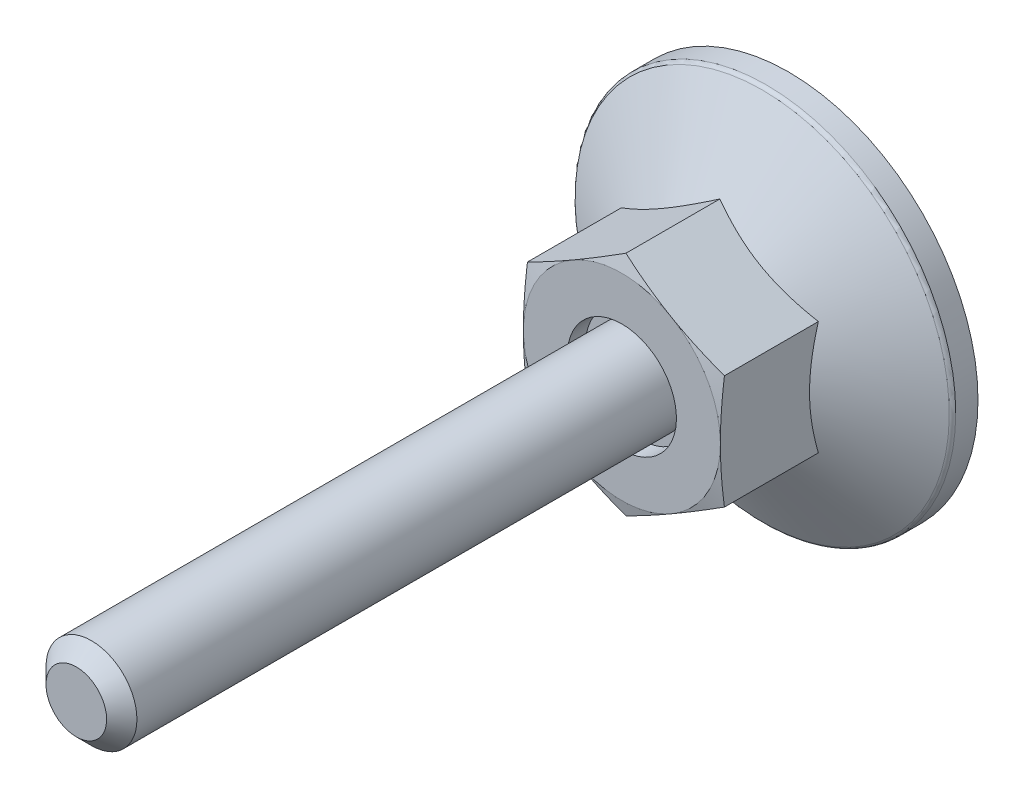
ISO-10303-21;
HEADER;
FILE_DESCRIPTION(('STEP AP214'),'2;1');
FILE_NAME('part.step','',(''),(''),'','','');
FILE_SCHEMA(('AUTOMOTIVE_DESIGN { 1 0 10303 214 1 1 1 1 }'));
ENDSEC;
DATA;
#1=APPLICATION_CONTEXT('core data for automotive mechanical design processes');
#2=APPLICATION_PROTOCOL_DEFINITION('international standard','automotive_design',2000,#1);
#3=PRODUCT_CONTEXT('',#1,'mechanical');
#4=PRODUCT('Part','Part','',(#3));
#5=PRODUCT_RELATED_PRODUCT_CATEGORY('part','',(#4));
#6=PRODUCT_DEFINITION_FORMATION('','',#4);
#7=PRODUCT_DEFINITION_CONTEXT('part definition',#1,'design');
#8=PRODUCT_DEFINITION('design','',#6,#7);
#9=PRODUCT_DEFINITION_SHAPE('','',#8);
#10=(LENGTH_UNIT() NAMED_UNIT(*) SI_UNIT(.MILLI.,.METRE.));
#11=(NAMED_UNIT(*) PLANE_ANGLE_UNIT() SI_UNIT($,.RADIAN.));
#12=(NAMED_UNIT(*) SI_UNIT($,.STERADIAN.) SOLID_ANGLE_UNIT());
#13=UNCERTAINTY_MEASURE_WITH_UNIT(LENGTH_MEASURE(1.E-05),#10,'distance_accuracy_value','');
#14=(GEOMETRIC_REPRESENTATION_CONTEXT(3) GLOBAL_UNCERTAINTY_ASSIGNED_CONTEXT((#13)) GLOBAL_UNIT_ASSIGNED_CONTEXT((#10,
#11,#12)) REPRESENTATION_CONTEXT('',''));
#15=CARTESIAN_POINT('',(0.,0.,0.));
#16=DIRECTION('',(0.,0.,1.));
#17=DIRECTION('',(1.,0.,0.));
#18=AXIS2_PLACEMENT_3D('',#15,#16,#17);
#19=CARTESIAN_POINT('',(7.8,0.,0.));
#20=DIRECTION('',(0.,0.,1.));
#21=DIRECTION('',(0.,-1.,0.));
#22=AXIS2_PLACEMENT_3D('',#19,#20,#21);
#23=PLANE('',#22);
#24=DIRECTION('',(1.,0.,0.));
#25=VECTOR('',#24,1.);
#26=CARTESIAN_POINT('',(1.,-1.,0.));
#27=LINE('',#26,#25);
#28=CARTESIAN_POINT('',(1.,-1.,0.));
#29=VERTEX_POINT('',#28);
#30=CARTESIAN_POINT('',(4.16666666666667,-1.,0.));
#31=VERTEX_POINT('',#30);
#32=EDGE_CURVE('E353',#29,#31,#27,.T.);
#33=ORIENTED_EDGE('',*,*,#32,.T.);
#34=DIRECTION('',(0.,-1.,0.));
#35=VECTOR('',#34,1.);
#36=CARTESIAN_POINT('',(4.16666666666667,0.,0.));
#37=LINE('',#36,#35);
#38=CARTESIAN_POINT('',(4.16666666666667,1.,0.));
#39=VERTEX_POINT('',#38);
#40=EDGE_CURVE('E375',#39,#31,#37,.T.);
#41=ORIENTED_EDGE('',*,*,#40,.F.);
#42=DIRECTION('',(-1.,0.,0.));
#43=VECTOR('',#42,1.);
#44=CARTESIAN_POINT('',(4.16666666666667,1.,0.));
#45=LINE('',#44,#43);
#46=CARTESIAN_POINT('',(1.,1.,0.));
#47=VERTEX_POINT('',#46);
#48=EDGE_CURVE('E737',#39,#47,#45,.T.);
#49=ORIENTED_EDGE('',*,*,#48,.T.);
#50=DIRECTION('',(0.,1.,0.));
#51=VECTOR('',#50,1.);
#52=CARTESIAN_POINT('',(1.,1.,0.));
#53=LINE('',#52,#51);
#54=CARTESIAN_POINT('',(1.,4.16666666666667,0.));
#55=VERTEX_POINT('',#54);
#56=EDGE_CURVE('E734',#47,#55,#53,.T.);
#57=ORIENTED_EDGE('',*,*,#56,.T.);
#58=DIRECTION('',(-1.,0.,0.));
#59=VECTOR('',#58,1.);
#60=CARTESIAN_POINT('',(1.,4.16666666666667,0.));
#61=LINE('',#60,#59);
#62=CARTESIAN_POINT('',(-1.,4.16666666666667,0.));
#63=VERTEX_POINT('',#62);
#64=EDGE_CURVE('E728',#55,#63,#61,.T.);
#65=ORIENTED_EDGE('',*,*,#64,.T.);
#66=DIRECTION('',(0.,-1.,0.));
#67=VECTOR('',#66,1.);
#68=CARTESIAN_POINT('',(-1.,4.16666666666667,0.));
#69=LINE('',#68,#67);
#70=CARTESIAN_POINT('',(-1.,1.,0.));
#71=VERTEX_POINT('',#70);
#72=EDGE_CURVE('E175',#63,#71,#69,.T.);
#73=ORIENTED_EDGE('',*,*,#72,.T.);
#74=DIRECTION('',(-1.,0.,0.));
#75=VECTOR('',#74,1.);
#76=CARTESIAN_POINT('',(-1.,1.,0.));
#77=LINE('',#76,#75);
#78=CARTESIAN_POINT('',(-4.16666666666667,1.,0.));
#79=VERTEX_POINT('',#78);
#80=EDGE_CURVE('E29',#71,#79,#77,.T.);
#81=ORIENTED_EDGE('',*,*,#80,.T.);
#82=DIRECTION('',(0.,-1.,0.));
#83=VECTOR('',#82,1.);
#84=CARTESIAN_POINT('',(-4.16666666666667,1.,0.));
#85=LINE('',#84,#83);
#86=CARTESIAN_POINT('',(-4.16666666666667,-1.,0.));
#87=VERTEX_POINT('',#86);
#88=EDGE_CURVE('E179',#79,#87,#85,.T.);
#89=ORIENTED_EDGE('',*,*,#88,.T.);
#90=DIRECTION('',(1.,0.,0.));
#91=VECTOR('',#90,1.);
#92=CARTESIAN_POINT('',(-4.16666666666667,-1.,0.));
#93=LINE('',#92,#91);
#94=CARTESIAN_POINT('',(-1.,-1.,0.));
#95=VERTEX_POINT('',#94);
#96=EDGE_CURVE('E762',#87,#95,#93,.T.);
#97=ORIENTED_EDGE('',*,*,#96,.T.);
#98=DIRECTION('',(0.,-1.,0.));
#99=VECTOR('',#98,1.);
#100=CARTESIAN_POINT('',(-1.,-1.,0.));
#101=LINE('',#100,#99);
#102=CARTESIAN_POINT('',(-1.,-4.16666666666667,0.));
#103=VERTEX_POINT('',#102);
#104=EDGE_CURVE('E764',#95,#103,#101,.T.);
#105=ORIENTED_EDGE('',*,*,#104,.T.);
#106=DIRECTION('',(1.,0.,0.));
#107=VECTOR('',#106,1.);
#108=CARTESIAN_POINT('',(-1.,-4.16666666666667,0.));
#109=LINE('',#108,#107);
#110=CARTESIAN_POINT('',(1.,-4.16666666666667,0.));
#111=VERTEX_POINT('',#110);
#112=EDGE_CURVE('E768',#103,#111,#109,.T.);
#113=ORIENTED_EDGE('',*,*,#112,.T.);
#114=DIRECTION('',(0.,1.,0.));
#115=VECTOR('',#114,1.);
#116=CARTESIAN_POINT('',(1.,-4.16666666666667,0.));
#117=LINE('',#116,#115);
#118=EDGE_CURVE('E775',#111,#29,#117,.T.);
#119=ORIENTED_EDGE('',*,*,#118,.T.);
#120=EDGE_LOOP('',(#33,#41,#49,#57,#65,#73,#81,#89,#97,#105,#113,#119));
#121=FACE_BOUND('',#120,.T.);
#122=CARTESIAN_POINT('',(0.,0.,0.));
#123=DIRECTION('',(0.,0.,-1.));
#124=DIRECTION('',(0.,1.,0.));
#125=AXIS2_PLACEMENT_3D('',#122,#123,#124);
#126=CIRCLE('',#125,12.5);
#127=CARTESIAN_POINT('',(0.,12.5,0.));
#128=VERTEX_POINT('',#127);
#129=EDGE_CURVE('E184',#128,#128,#126,.T.);
#130=ORIENTED_EDGE('',*,*,#129,.T.);
#131=EDGE_LOOP('',(#130));
#132=FACE_BOUND('',#131,.T.);
#133=ADVANCED_FACE('F14',(#121,#132),#23,.F.);
#134=CARTESIAN_POINT('',(0.,0.,9.8));
#135=DIRECTION('',(0.,0.,-1.));
#136=DIRECTION('',(0.,1.,0.));
#137=AXIS2_PLACEMENT_3D('',#134,#135,#136);
#138=PLANE('',#137);
#139=CARTESIAN_POINT('',(0.,0.,9.8));
#140=DIRECTION('',(0.,0.,-1.));
#141=DIRECTION('',(0.,1.,0.));
#142=AXIS2_PLACEMENT_3D('',#139,#140,#141);
#143=CIRCLE('',#142,3.6);
#144=CARTESIAN_POINT('',(0.,3.6,9.8));
#145=VERTEX_POINT('',#144);
#146=EDGE_CURVE('E376',#145,#145,#143,.T.);
#147=ORIENTED_EDGE('',*,*,#146,.F.);
#148=EDGE_LOOP('',(#147));
#149=FACE_BOUND('',#148,.T.);
#150=CARTESIAN_POINT('',(0.,0.,9.8));
#151=DIRECTION('',(0.,0.,-1.));
#152=DIRECTION('',(0.,1.,0.));
#153=AXIS2_PLACEMENT_3D('',#150,#151,#152);
#154=CIRCLE('',#153,3.);
#155=CARTESIAN_POINT('',(0.,3.,9.8));
#156=VERTEX_POINT('',#155);
#157=EDGE_CURVE('E180',#156,#156,#154,.F.);
#158=ORIENTED_EDGE('',*,*,#157,.F.);
#159=EDGE_LOOP('',(#158));
#160=FACE_BOUND('',#159,.T.);
#161=ADVANCED_FACE('F341',(#149,#160),#138,.F.);
#162=CARTESIAN_POINT('',(0.,7.50555349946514,48.));
#163=DIRECTION('',(0.5,-0.866025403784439,0.));
#164=DIRECTION('',(0.866025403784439,0.5,0.));
#165=AXIS2_PLACEMENT_3D('',#162,#163,#164);
#166=PLANE('',#165);
#167=CARTESIAN_POINT('',(-6.5002,3.75266127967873,4.53347836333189));
#168=CARTESIAN_POINT('',(-6.35732254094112,3.83515161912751,4.58109719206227));
#169=CARTESIAN_POINT('',(-6.21391236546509,3.91794952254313,4.62655491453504));
#170=CARTESIAN_POINT('',(-5.92592736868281,4.08421773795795,4.7125529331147));
#171=CARTESIAN_POINT('',(-5.78135207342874,4.16768832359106,4.75309110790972));
#172=CARTESIAN_POINT('',(-5.34531134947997,4.41943655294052,4.86653061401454));
#173=CARTESIAN_POINT('',(-5.05212471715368,4.5887079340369,4.93105380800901));
#174=CARTESIAN_POINT('',(-4.61337625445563,4.84201947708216,5.00671503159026));
#175=CARTESIAN_POINT('',(-4.46912536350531,4.92530276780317,5.02826875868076));
#176=CARTESIAN_POINT('',(-4.17997178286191,5.09224566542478,5.06441130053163));
#177=CARTESIAN_POINT('',(-4.03506915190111,5.17590523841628,5.07900073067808));
#178=CARTESIAN_POINT('',(-3.74501222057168,5.34336968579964,5.1008428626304));
#179=CARTESIAN_POINT('',(-3.59985839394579,5.42717428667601,5.10810389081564));
#180=CARTESIAN_POINT('',(-3.30942466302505,5.59485627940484,5.11514131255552));
#181=CARTESIAN_POINT('',(-3.16414476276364,5.6787336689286,5.11491793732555));
#182=CARTESIAN_POINT('',(-2.7661240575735,5.90853103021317,5.10401815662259));
#183=CARTESIAN_POINT('',(-2.51351353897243,6.05437578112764,5.08571979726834));
#184=CARTESIAN_POINT('',(-2.00997032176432,6.34509659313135,5.02769527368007));
#185=CARTESIAN_POINT('',(-1.75903939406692,6.48997163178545,4.98794927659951));
#186=CARTESIAN_POINT('',(-1.25448277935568,6.78127752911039,4.8885957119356));
#187=CARTESIAN_POINT('',(-1.00092075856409,6.92767163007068,4.82856718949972));
#188=CARTESIAN_POINT('',(-0.497578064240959,7.21827667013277,4.69232662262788));
#189=CARTESIAN_POINT('',(-0.247790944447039,7.36249133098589,4.61614658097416));
#190=CARTESIAN_POINT('',(0.000199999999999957,7.50566896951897,4.53347836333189));
#191=B_SPLINE_CURVE_WITH_KNOTS('',3,(#167,#168,#169,#170,#171,#172,#173,#174,#175,#176,#177,
#178,#179,#180,#181,#182,#183,#184,#185,#186,#187,#188,#189,#190),.UNSPECIFIED.,.F.,.F.,(4,2,2,
2,2,2,2,2,2,2,2,4),(0.,0.515105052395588,1.03043143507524,2.06322554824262,2.56697389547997,
3.07067772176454,3.57380860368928,4.0769239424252,4.9527935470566,5.82947446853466,
6.72559912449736,7.61996451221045),.UNSPECIFIED.);
#192=CARTESIAN_POINT('',(-6.5,3.75277674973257,4.53354503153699));
#193=VERTEX_POINT('',#192);
#194=CARTESIAN_POINT('',(0.,7.50555349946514,4.53354503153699));
#195=VERTEX_POINT('',#194);
#196=EDGE_CURVE('E254',#193,#195,#191,.T.);
#197=ORIENTED_EDGE('',*,*,#196,.F.);
#198=DIRECTION('',(0.,0.,-1.));
#199=VECTOR('',#198,1.);
#200=CARTESIAN_POINT('',(-6.5,3.75277674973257,48.));
#201=LINE('',#200,#199);
#202=CARTESIAN_POINT('',(-6.5,3.75277674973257,10.730562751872));
#203=VERTEX_POINT('',#202);
#204=EDGE_CURVE('E429',#203,#193,#201,.T.);
#205=ORIENTED_EDGE('',*,*,#204,.F.);
#206=CARTESIAN_POINT('',(0.0002,7.50566896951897,10.7305318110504));
#207=CARTESIAN_POINT('',(-0.26974524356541,7.34981601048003,10.772310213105));
#208=CARTESIAN_POINT('',(-0.540179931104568,7.19368047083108,10.8102381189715));
#209=CARTESIAN_POINT('',(-1.08200437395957,6.88085798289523,10.8768739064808));
#210=CARTESIAN_POINT('',(-1.35339447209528,6.72417083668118,10.9055780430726));
#211=CARTESIAN_POINT('',(-1.8954842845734,6.41119513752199,10.9520905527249));
#212=CARTESIAN_POINT('',(-2.16618033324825,6.25490870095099,10.9699543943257));
#213=CARTESIAN_POINT('',(-2.70791763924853,5.94213652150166,10.9939079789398));
#214=CARTESIAN_POINT('',(-2.97895881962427,5.78565082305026,11.));
#215=CARTESIAN_POINT('',(-3.52104118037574,5.47267942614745,11.));
#216=CARTESIAN_POINT('',(-3.79208236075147,5.31619372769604,10.9939079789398));
#217=CARTESIAN_POINT('',(-4.33381966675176,5.00342154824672,10.9699543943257));
#218=CARTESIAN_POINT('',(-4.60451571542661,4.84713511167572,10.9520905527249));
#219=CARTESIAN_POINT('',(-5.14660552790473,4.53415941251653,10.9055780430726));
#220=CARTESIAN_POINT('',(-5.41799562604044,4.37747226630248,10.8768739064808));
#221=CARTESIAN_POINT('',(-5.95982006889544,4.06464977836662,10.8102381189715));
#222=CARTESIAN_POINT('',(-6.23025475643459,3.90851423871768,10.772310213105));
#223=CARTESIAN_POINT('',(-6.5002,3.75266127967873,10.7305318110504));
#224=B_SPLINE_CURVE_WITH_KNOTS('',3,(#206,#207,#208,#209,#210,#211,#212,#213,#214,#215,#216,
#217,#218,#219,#220,#221,#222,#223),.UNSPECIFIED.,.F.,.F.,(4,2,2,2,2,2,2,2,4),(0.,
0.943529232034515,1.88744107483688,2.82648138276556,3.76533995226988,4.70419852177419,
5.64323882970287,6.58715067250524,7.53067990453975),.UNSPECIFIED.);
#225=CARTESIAN_POINT('',(-3.25,5.62916512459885,11.));
#226=VERTEX_POINT('',#225);
#227=EDGE_CURVE('E284',#226,#203,#224,.T.);
#228=ORIENTED_EDGE('',*,*,#227,.F.);
#229=CARTESIAN_POINT('',(0.,7.50555349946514,10.730562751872));
#230=VERTEX_POINT('',#229);
#231=EDGE_CURVE('E394',#230,#226,#224,.T.);
#232=ORIENTED_EDGE('',*,*,#231,.F.);
#233=DIRECTION('',(0.,0.,-1.));
#234=VECTOR('',#233,1.);
#235=CARTESIAN_POINT('',(0.,7.50555349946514,48.));
#236=LINE('',#235,#234);
#237=EDGE_CURVE('E415',#230,#195,#236,.T.);
#238=ORIENTED_EDGE('',*,*,#237,.T.);
#239=EDGE_LOOP('',(#197,#205,#228,#232,#238));
#240=FACE_BOUND('',#239,.T.);
#241=ADVANCED_FACE('F226',(#240),#166,.F.);
#242=CARTESIAN_POINT('',(6.5,3.75277674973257,48.));
#243=DIRECTION('',(-0.5,-0.866025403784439,0.));
#244=DIRECTION('',(0.866025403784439,-0.5,0.));
#245=AXIS2_PLACEMENT_3D('',#242,#243,#244);
#246=PLANE('',#245);
#247=CARTESIAN_POINT('',(-0.0002,7.50566896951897,4.53347836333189));
#248=CARTESIAN_POINT('',(0.142677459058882,7.4231786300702,4.58109719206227));
#249=CARTESIAN_POINT('',(0.286087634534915,7.34038072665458,4.62655491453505));
#250=CARTESIAN_POINT('',(0.574072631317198,7.17411251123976,4.71255293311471));
#251=CARTESIAN_POINT('',(0.718647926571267,7.09064192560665,4.75309110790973));
#252=CARTESIAN_POINT('',(1.15468865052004,6.83889369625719,4.86653061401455));
#253=CARTESIAN_POINT('',(1.44787528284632,6.66962231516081,4.93105380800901));
#254=CARTESIAN_POINT('',(1.88662374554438,6.41631077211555,5.00671503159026));
#255=CARTESIAN_POINT('',(2.03087463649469,6.33302748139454,5.02826875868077));
#256=CARTESIAN_POINT('',(2.32002821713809,6.16608458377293,5.06441130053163));
#257=CARTESIAN_POINT('',(2.46493084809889,6.08242501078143,5.07900073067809));
#258=CARTESIAN_POINT('',(2.75498777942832,5.91496056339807,5.10084286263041));
#259=CARTESIAN_POINT('',(2.90014160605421,5.8311559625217,5.10810389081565));
#260=CARTESIAN_POINT('',(3.19057533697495,5.66347396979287,5.11514131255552));
#261=CARTESIAN_POINT('',(3.33585523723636,5.5795965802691,5.11491793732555));
#262=CARTESIAN_POINT('',(3.73387594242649,5.34979921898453,5.10401815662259));
#263=CARTESIAN_POINT('',(3.98648646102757,5.20395446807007,5.08571979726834));
#264=CARTESIAN_POINT('',(4.49002967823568,4.91323365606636,5.02769527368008));
#265=CARTESIAN_POINT('',(4.74096060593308,4.76835861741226,4.98794927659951));
#266=CARTESIAN_POINT('',(5.24551722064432,4.47705272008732,4.8885957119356));
#267=CARTESIAN_POINT('',(5.49907924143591,4.33065861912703,4.82856718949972));
#268=CARTESIAN_POINT('',(6.00242193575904,4.04005357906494,4.69232662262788));
#269=CARTESIAN_POINT('',(6.25220905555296,3.89583891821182,4.61614658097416));
#270=CARTESIAN_POINT('',(6.5002,3.75266127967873,4.53347836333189));
#271=B_SPLINE_CURVE_WITH_KNOTS('',3,(#247,#248,#249,#250,#251,#252,#253,#254,#255,#256,#257,
#258,#259,#260,#261,#262,#263,#264,#265,#266,#267,#268,#269,#270),.UNSPECIFIED.,.F.,.F.,(4,2,2,
2,2,2,2,2,2,2,2,4),(0.,0.515105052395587,1.03043143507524,2.06322554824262,2.56697389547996,
3.07067772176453,3.57380860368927,4.0769239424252,4.9527935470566,5.82947446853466,
6.72559912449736,7.61996451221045),.UNSPECIFIED.);
#272=CARTESIAN_POINT('',(6.5,3.75277674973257,4.53354503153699));
#273=VERTEX_POINT('',#272);
#274=EDGE_CURVE('E37',#195,#273,#271,.T.);
#275=ORIENTED_EDGE('',*,*,#274,.F.);
#276=ORIENTED_EDGE('',*,*,#237,.F.);
#277=CARTESIAN_POINT('',(6.5002,3.75266127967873,10.7305318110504));
#278=CARTESIAN_POINT('',(6.23025475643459,3.90851423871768,10.772310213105));
#279=CARTESIAN_POINT('',(5.95982006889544,4.06464977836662,10.8102381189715));
#280=CARTESIAN_POINT('',(5.41799562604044,4.37747226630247,10.8768739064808));
#281=CARTESIAN_POINT('',(5.14660552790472,4.53415941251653,10.9055780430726));
#282=CARTESIAN_POINT('',(4.60451571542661,4.84713511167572,10.9520905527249));
#283=CARTESIAN_POINT('',(4.33381966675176,5.00342154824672,10.9699543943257));
#284=CARTESIAN_POINT('',(3.79208236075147,5.31619372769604,10.9939079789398));
#285=CARTESIAN_POINT('',(3.52104118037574,5.47267942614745,11.));
#286=CARTESIAN_POINT('',(2.97895881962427,5.78565082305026,11.));
#287=CARTESIAN_POINT('',(2.70791763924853,5.94213652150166,10.9939079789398));
#288=CARTESIAN_POINT('',(2.16618033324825,6.25490870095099,10.9699543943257));
#289=CARTESIAN_POINT('',(1.89548428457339,6.41119513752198,10.9520905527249));
#290=CARTESIAN_POINT('',(1.35339447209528,6.72417083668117,10.9055780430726));
#291=CARTESIAN_POINT('',(1.08200437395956,6.88085798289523,10.8768739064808));
#292=CARTESIAN_POINT('',(0.540179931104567,7.19368047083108,10.8102381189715));
#293=CARTESIAN_POINT('',(0.26974524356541,7.34981601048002,10.772310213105));
#294=CARTESIAN_POINT('',(-0.000199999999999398,7.50566896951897,10.7305318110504));
#295=B_SPLINE_CURVE_WITH_KNOTS('',3,(#277,#278,#279,#280,#281,#282,#283,#284,#285,#286,#287,
#288,#289,#290,#291,#292,#293,#294),.UNSPECIFIED.,.F.,.F.,(4,2,2,2,2,2,2,2,4),(0.,
0.943529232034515,1.88744107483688,2.82648138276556,3.76533995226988,4.70419852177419,
5.64323882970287,6.58715067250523,7.53067990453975),.UNSPECIFIED.);
#296=CARTESIAN_POINT('',(3.25,5.62916512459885,11.));
#297=VERTEX_POINT('',#296);
#298=EDGE_CURVE('E267',#297,#230,#295,.T.);
#299=ORIENTED_EDGE('',*,*,#298,.F.);
#300=CARTESIAN_POINT('',(6.5,3.75277674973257,10.730562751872));
#301=VERTEX_POINT('',#300);
#302=EDGE_CURVE('E276',#301,#297,#295,.T.);
#303=ORIENTED_EDGE('',*,*,#302,.F.);
#304=DIRECTION('',(0.,0.,-1.));
#305=VECTOR('',#304,1.);
#306=CARTESIAN_POINT('',(6.5,3.75277674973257,48.));
#307=LINE('',#306,#305);
#308=EDGE_CURVE('E417',#301,#273,#307,.T.);
#309=ORIENTED_EDGE('',*,*,#308,.T.);
#310=EDGE_LOOP('',(#275,#276,#299,#303,#309));
#311=FACE_BOUND('',#310,.T.);
#312=ADVANCED_FACE('F260',(#311),#246,.F.);
#313=CARTESIAN_POINT('',(6.5,-3.75277674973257,48.));
#314=DIRECTION('',(-1.,0.,0.));
#315=DIRECTION('',(0.,-1.,0.));
#316=AXIS2_PLACEMENT_3D('',#313,#314,#315);
#317=PLANE('',#316);
#318=CARTESIAN_POINT('',(6.5,10.067414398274,1.94823609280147));
#319=CARTESIAN_POINT('',(6.5,9.78352438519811,2.08589580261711));
#320=CARTESIAN_POINT('',(6.5,9.49898106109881,2.22223138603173));
#321=CARTESIAN_POINT('',(6.5,8.92824011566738,2.49150895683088));
#322=CARTESIAN_POINT('',(6.5,8.64204224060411,2.62445040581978));
#323=CARTESIAN_POINT('',(6.5,8.06616487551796,2.88686541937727));
#324=CARTESIAN_POINT('',(6.5,7.77647490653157,3.01631606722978));
#325=CARTESIAN_POINT('',(6.5,7.19478507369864,3.26989907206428));
#326=CARTESIAN_POINT('',(6.5,6.90278532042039,3.39403168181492));
#327=CARTESIAN_POINT('',(6.5,6.30684739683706,3.63934571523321));
#328=CARTESIAN_POINT('',(6.5,6.00282105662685,3.76031411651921));
#329=CARTESIAN_POINT('',(6.5,5.39120706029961,3.99306391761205));
#330=CARTESIAN_POINT('',(6.5,5.08361900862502,4.10484428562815));
#331=CARTESIAN_POINT('',(6.5,4.46497231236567,4.31627594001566));
#332=CARTESIAN_POINT('',(6.5,4.15392216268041,4.41595183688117));
#333=CARTESIAN_POINT('',(6.5,3.52735818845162,4.59996747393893));
#334=CARTESIAN_POINT('',(6.5,3.21184580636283,4.68431205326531));
#335=CARTESIAN_POINT('',(6.5,2.57783458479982,4.83319256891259));
#336=CARTESIAN_POINT('',(6.5,2.25935972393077,4.89782898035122));
#337=CARTESIAN_POINT('',(6.5,1.61842059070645,5.00357646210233));
#338=CARTESIAN_POINT('',(6.5,1.29595672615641,5.04468991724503));
#339=CARTESIAN_POINT('',(6.5,0.812693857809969,5.08598811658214));
#340=CARTESIAN_POINT('',(6.5,0.652724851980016,5.09635596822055));
#341=CARTESIAN_POINT('',(6.5,0.332484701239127,5.11032435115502));
#342=CARTESIAN_POINT('',(6.5,0.172213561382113,5.11392499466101));
#343=CARTESIAN_POINT('',(6.5,-0.148338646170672,5.11426557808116));
#344=CARTESIAN_POINT('',(6.5,-0.30861971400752,5.11100536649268));
#345=CARTESIAN_POINT('',(6.5,-0.628902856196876,5.09770543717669));
#346=CARTESIAN_POINT('',(6.5,-0.788904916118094,5.08766537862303));
#347=CARTESIAN_POINT('',(6.5,-1.17366735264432,5.05558094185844));
#348=CARTESIAN_POINT('',(6.5,-1.39816400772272,5.03030719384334));
#349=CARTESIAN_POINT('',(6.5,-1.84547349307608,4.96779217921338));
#350=CARTESIAN_POINT('',(6.5,-2.06828609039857,4.93054928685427));
#351=CARTESIAN_POINT('',(6.5,-2.73393776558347,4.80284369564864));
#352=CARTESIAN_POINT('',(6.5,-3.17375537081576,4.6964262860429));
#353=CARTESIAN_POINT('',(6.5,-3.83171733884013,4.51203063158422));
#354=CARTESIAN_POINT('',(6.5,-4.05327258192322,4.44552609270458));
#355=CARTESIAN_POINT('',(6.5,-4.49422901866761,4.30565892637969));
#356=CARTESIAN_POINT('',(6.5,-4.71363019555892,4.23229624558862));
#357=CARTESIAN_POINT('',(6.5,-5.15035386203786,4.07988627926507));
#358=CARTESIAN_POINT('',(6.5,-5.3676769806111,4.00084077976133));
#359=CARTESIAN_POINT('',(6.5,-5.80052072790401,3.83799065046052));
#360=CARTESIAN_POINT('',(6.5,-6.01604140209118,3.75418614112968));
#361=CARTESIAN_POINT('',(6.5,-6.61842771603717,3.51353035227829));
#362=CARTESIAN_POINT('',(6.5,-7.00350435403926,3.35220459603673));
#363=CARTESIAN_POINT('',(6.5,-7.76959629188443,3.02014813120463));
#364=CARTESIAN_POINT('',(6.5,-8.15061109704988,2.84941629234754));
#365=CARTESIAN_POINT('',(6.5,-8.90957192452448,2.50088582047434));
#366=CARTESIAN_POINT('',(6.5,-9.28751663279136,2.3230843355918));
#367=CARTESIAN_POINT('',(6.5,-10.0408394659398,1.96218611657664));
#368=CARTESIAN_POINT('',(6.5,-10.4162177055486,1.77908962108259));
#369=CARTESIAN_POINT('',(6.5,-11.1655631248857,1.40849620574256));
#370=CARTESIAN_POINT('',(6.5,-11.5395269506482,1.22099251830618));
#371=CARTESIAN_POINT('',(6.5,-12.2858210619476,0.842758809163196));
#372=CARTESIAN_POINT('',(6.5,-12.6581513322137,0.652028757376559));
#373=CARTESIAN_POINT('',(6.5,-13.4013949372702,0.268043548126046));
#374=CARTESIAN_POINT('',(6.5,-13.7723085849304,0.0747889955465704));
#375=CARTESIAN_POINT('',(6.5,-14.5130449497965,-0.313800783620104));
#376=CARTESIAN_POINT('',(6.5,-14.8828676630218,-0.509136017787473));
#377=CARTESIAN_POINT('',(6.5,-15.9085714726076,-1.05391022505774));
#378=CARTESIAN_POINT('',(6.5,-16.5634819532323,-1.40517623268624));
#379=CARTESIAN_POINT('',(6.5,-17.8712672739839,-2.11157255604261));
#380=CARTESIAN_POINT('',(6.5,-18.5241419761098,-2.4667031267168));
#381=CARTESIAN_POINT('',(6.5,-19.8261496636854,-3.17862531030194));
#382=CARTESIAN_POINT('',(6.5,-20.475287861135,-3.53540739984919));
#383=CARTESIAN_POINT('',(6.5,-21.7722968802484,-4.25114422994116));
#384=CARTESIAN_POINT('',(6.5,-22.4201678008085,-4.61009879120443));
#385=CARTESIAN_POINT('',(6.5,-23.0675997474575,-4.9698379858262));
#386=B_SPLINE_CURVE_WITH_KNOTS('',3,(#318,#319,#320,#321,#322,#323,#324,#325,#326,#327,#328,
#329,#330,#331,#332,#333,#334,#335,#336,#337,#338,#339,#340,#341,#342,#343,#344,#345,#346,#347,
#348,#349,#350,#351,#352,#353,#354,#355,#356,#357,#358,#359,#360,#361,#362,#363,#364,#365,#366,
#367,#368,#369,#370,#371,#372,#373,#374,#375,#376,#377,#378,#379,#380,#381,#382,#383,#384,#385),
.UNSPECIFIED.,.F.,.F.,(4,2,2,2,2,2,2,2,2,2,2,2,2,2,2,2,2,2,2,2,2,2,2,2,2,2,2,2,2,2,2,2,2,4),(0.,
0.946528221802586,1.89320566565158,2.84505559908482,3.79686024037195,4.77837094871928,
5.75999172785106,6.73958204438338,7.71886262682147,8.69306383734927,9.66716626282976,
10.1479587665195,10.6287432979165,11.1095384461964,11.5903577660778,12.267719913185,
12.9451741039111,14.3007885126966,14.9946950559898,15.6886069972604,16.3823017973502,
17.0759790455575,18.3282990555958,19.5807698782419,20.8337511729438,22.086676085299,
23.3416700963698,24.5966758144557,25.8513861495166,27.1061010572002,29.335578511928,
31.5652039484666,33.7873748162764,36.0093647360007),.UNSPECIFIED.);
#387=CARTESIAN_POINT('',(6.5,-3.75277674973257,4.53354503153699));
#388=VERTEX_POINT('',#387);
#389=EDGE_CURVE('E243',#273,#388,#386,.T.);
#390=ORIENTED_EDGE('',*,*,#389,.F.);
#391=ORIENTED_EDGE('',*,*,#308,.F.);
#392=CARTESIAN_POINT('',(6.5,9.92747995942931,9.56215186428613));
#393=CARTESIAN_POINT('',(6.5,9.63259364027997,9.62823955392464));
#394=CARTESIAN_POINT('',(6.5,9.33752287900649,9.69351898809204));
#395=CARTESIAN_POINT('',(6.5,8.7469218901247,9.82202506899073));
#396=CARTESIAN_POINT('',(6.5,8.45139164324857,9.88525162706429));
#397=CARTESIAN_POINT('',(6.5,7.85951636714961,10.0092707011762));
#398=CARTESIAN_POINT('',(6.5,7.56317082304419,10.0700607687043));
#399=CARTESIAN_POINT('',(6.5,6.96986292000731,10.1885506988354));
#400=CARTESIAN_POINT('',(6.5,6.67290056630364,10.2462505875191));
#401=CARTESIAN_POINT('',(6.5,6.08062010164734,10.3573796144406));
#402=CARTESIAN_POINT('',(6.5,5.78530770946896,10.4108390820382));
#403=CARTESIAN_POINT('',(6.5,5.19387740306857,10.513090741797));
#404=CARTESIAN_POINT('',(6.5,4.89775950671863,10.5618830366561));
#405=CARTESIAN_POINT('',(6.5,4.30466070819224,10.6537017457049));
#406=CARTESIAN_POINT('',(6.5,4.00767991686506,10.6967288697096));
#407=CARTESIAN_POINT('',(6.5,3.4127732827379,10.7757492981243));
#408=CARTESIAN_POINT('',(6.5,3.1148474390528,10.8117425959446));
#409=CARTESIAN_POINT('',(6.5,2.51468954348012,10.8756761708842));
#410=CARTESIAN_POINT('',(6.5,2.21244707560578,10.9035201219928));
#411=CARTESIAN_POINT('',(6.5,1.60720229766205,10.9492341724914));
#412=CARTESIAN_POINT('',(6.5,1.30420000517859,10.9671045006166));
#413=CARTESIAN_POINT('',(6.5,0.697875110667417,10.9918290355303));
#414=CARTESIAN_POINT('',(6.5,0.394552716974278,10.9986882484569));
#415=CARTESIAN_POINT('',(6.5,-0.212135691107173,11.0009688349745));
#416=CARTESIAN_POINT('',(6.5,-0.515501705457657,10.9963902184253));
#417=CARTESIAN_POINT('',(6.5,-1.12295501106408,10.9760526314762));
#418=CARTESIAN_POINT('',(6.5,-1.42704091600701,10.9602530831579));
#419=CARTESIAN_POINT('',(6.5,-2.03449758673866,10.9183754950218));
#420=CARTESIAN_POINT('',(6.5,-2.33786833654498,10.8922972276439));
#421=CARTESIAN_POINT('',(6.5,-2.94389214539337,10.8311794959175));
#422=CARTESIAN_POINT('',(6.5,-3.24654460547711,10.7961341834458));
#423=CARTESIAN_POINT('',(6.5,-3.85087551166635,10.7185406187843));
#424=CARTESIAN_POINT('',(6.5,-4.15255395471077,10.6759923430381));
#425=CARTESIAN_POINT('',(6.5,-4.73502363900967,10.5877746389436));
#426=CARTESIAN_POINT('',(6.5,-5.01587505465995,10.5424985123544));
#427=CARTESIAN_POINT('',(6.5,-5.57683763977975,10.4475514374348));
#428=CARTESIAN_POINT('',(6.5,-5.85694878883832,10.3978803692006));
#429=CARTESIAN_POINT('',(6.5,-6.41653333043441,10.2949474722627));
#430=CARTESIAN_POINT('',(6.5,-6.69600666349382,10.241685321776));
#431=CARTESIAN_POINT('',(6.5,-7.2543793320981,10.1322258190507));
#432=CARTESIAN_POINT('',(6.5,-7.53327866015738,10.0760284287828));
#433=CARTESIAN_POINT('',(6.5,-8.36936246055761,9.90383082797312));
#434=CARTESIAN_POINT('',(6.5,-8.92580841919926,9.78424858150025));
#435=CARTESIAN_POINT('',(6.5,-10.037220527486,9.53861051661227));
#436=CARTESIAN_POINT('',(6.5,-10.5921867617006,9.41255507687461));
#437=CARTESIAN_POINT('',(6.5,-11.6956125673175,9.15714489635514));
#438=CARTESIAN_POINT('',(6.5,-12.2440824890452,9.02783474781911));
#439=CARTESIAN_POINT('',(6.5,-13.3402571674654,8.76597711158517));
#440=CARTESIAN_POINT('',(6.5,-13.8879619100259,8.63342956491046));
#441=CARTESIAN_POINT('',(6.5,-14.9821103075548,8.36610757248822));
#442=CARTESIAN_POINT('',(6.5,-15.5285546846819,8.23133607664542));
#443=CARTESIAN_POINT('',(6.5,-16.620967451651,7.95995280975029));
#444=CARTESIAN_POINT('',(6.5,-17.166935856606,7.82334109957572));
#445=CARTESIAN_POINT('',(6.5,-17.7127383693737,7.6860776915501));
#446=B_SPLINE_CURVE_WITH_KNOTS('',3,(#392,#393,#394,#395,#396,#397,#398,#399,#400,#401,#402,
#403,#404,#405,#406,#407,#408,#409,#410,#411,#412,#413,#414,#415,#416,#417,#418,#419,#420,#421,
#422,#423,#424,#425,#426,#427,#428,#429,#430,#431,#432,#433,#434,#435,#436,#437,#438,#439,#440,
#441,#442,#443,#444,#445),.UNSPECIFIED.,.F.,.F.,(4,2,2,2,2,2,2,2,2,2,2,2,2,2,2,2,2,2,2,2,2,2,2,
2,2,2,4),(0.,0.906607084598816,1.8132532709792,2.72078883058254,3.62831672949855,
4.52862337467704,5.42891020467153,6.32908608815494,7.22926281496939,8.13968571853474,
9.05008774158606,9.96007573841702,10.8700629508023,11.7833577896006,12.6966728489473,
13.6105850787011,14.5245001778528,15.3778915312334,16.2313061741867,17.084797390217,
17.9382996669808,19.6456836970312,21.3529679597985,23.0434756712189,24.7340142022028,
26.4224665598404,28.1108631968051),.UNSPECIFIED.);
#447=CARTESIAN_POINT('',(6.5,0.,11.));
#448=VERTEX_POINT('',#447);
#449=EDGE_CURVE('E278',#448,#301,#446,.F.);
#450=ORIENTED_EDGE('',*,*,#449,.F.);
#451=CARTESIAN_POINT('',(6.5,-3.75277674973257,10.730562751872));
#452=VERTEX_POINT('',#451);
#453=EDGE_CURVE('E277',#452,#448,#446,.F.);
#454=ORIENTED_EDGE('',*,*,#453,.F.);
#455=DIRECTION('',(0.,0.,-1.));
#456=VECTOR('',#455,1.);
#457=CARTESIAN_POINT('',(6.5,-3.75277674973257,48.));
#458=LINE('',#457,#456);
#459=EDGE_CURVE('E420',#452,#388,#458,.T.);
#460=ORIENTED_EDGE('',*,*,#459,.T.);
#461=EDGE_LOOP('',(#390,#391,#450,#454,#460));
#462=FACE_BOUND('',#461,.T.);
#463=ADVANCED_FACE('F263',(#462),#317,.F.);
#464=CARTESIAN_POINT('',(0.,-7.50555349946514,48.));
#465=DIRECTION('',(-0.5,0.866025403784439,0.));
#466=DIRECTION('',(-0.866025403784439,-0.5,0.));
#467=AXIS2_PLACEMENT_3D('',#464,#465,#466);
#468=PLANE('',#467);
#469=CARTESIAN_POINT('',(6.5002,-3.75266127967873,4.53347836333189));
#470=CARTESIAN_POINT('',(6.35732254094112,-3.83515161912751,4.58109719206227));
#471=CARTESIAN_POINT('',(6.21391236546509,-3.91794952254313,4.62655491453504));
#472=CARTESIAN_POINT('',(5.92592736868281,-4.08421773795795,4.7125529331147));
#473=CARTESIAN_POINT('',(5.78135207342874,-4.16768832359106,4.75309110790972));
#474=CARTESIAN_POINT('',(5.34531134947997,-4.41943655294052,4.86653061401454));
#475=CARTESIAN_POINT('',(5.05212471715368,-4.5887079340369,4.93105380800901));
#476=CARTESIAN_POINT('',(4.61337625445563,-4.84201947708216,5.00671503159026));
#477=CARTESIAN_POINT('',(4.46912536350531,-4.92530276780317,5.02826875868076));
#478=CARTESIAN_POINT('',(4.17997178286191,-5.09224566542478,5.06441130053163));
#479=CARTESIAN_POINT('',(4.03506915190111,-5.17590523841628,5.07900073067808));
#480=CARTESIAN_POINT('',(3.74501222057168,-5.34336968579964,5.1008428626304));
#481=CARTESIAN_POINT('',(3.59985839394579,-5.42717428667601,5.10810389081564));
#482=CARTESIAN_POINT('',(3.30942466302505,-5.59485627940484,5.11514131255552));
#483=CARTESIAN_POINT('',(3.16414476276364,-5.6787336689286,5.11491793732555));
#484=CARTESIAN_POINT('',(2.7661240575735,-5.90853103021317,5.10401815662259));
#485=CARTESIAN_POINT('',(2.51351353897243,-6.05437578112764,5.08571979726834));
#486=CARTESIAN_POINT('',(2.00997032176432,-6.34509659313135,5.02769527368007));
#487=CARTESIAN_POINT('',(1.75903939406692,-6.48997163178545,4.98794927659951));
#488=CARTESIAN_POINT('',(1.25448277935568,-6.78127752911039,4.8885957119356));
#489=CARTESIAN_POINT('',(1.00092075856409,-6.92767163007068,4.82856718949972));
#490=CARTESIAN_POINT('',(0.497578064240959,-7.21827667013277,4.69232662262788));
#491=CARTESIAN_POINT('',(0.247790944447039,-7.36249133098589,4.61614658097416));
#492=CARTESIAN_POINT('',(-0.000199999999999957,-7.50566896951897,4.53347836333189));
#493=B_SPLINE_CURVE_WITH_KNOTS('',3,(#469,#470,#471,#472,#473,#474,#475,#476,#477,#478,#479,
#480,#481,#482,#483,#484,#485,#486,#487,#488,#489,#490,#491,#492),.UNSPECIFIED.,.F.,.F.,(4,2,2,
2,2,2,2,2,2,2,2,4),(0.,0.515105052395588,1.03043143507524,2.06322554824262,2.56697389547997,
3.07067772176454,3.57380860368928,4.0769239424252,4.9527935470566,5.82947446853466,
6.72559912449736,7.61996451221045),.UNSPECIFIED.);
#494=CARTESIAN_POINT('',(0.,-7.50555349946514,4.53354503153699));
#495=VERTEX_POINT('',#494);
#496=EDGE_CURVE('E207',#388,#495,#493,.T.);
#497=ORIENTED_EDGE('',*,*,#496,.F.);
#498=ORIENTED_EDGE('',*,*,#459,.F.);
#499=CARTESIAN_POINT('',(-0.0002,-7.50566896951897,10.7305318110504));
#500=CARTESIAN_POINT('',(0.26974524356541,-7.34981601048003,10.772310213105));
#501=CARTESIAN_POINT('',(0.540179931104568,-7.19368047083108,10.8102381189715));
#502=CARTESIAN_POINT('',(1.08200437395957,-6.88085798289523,10.8768739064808));
#503=CARTESIAN_POINT('',(1.35339447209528,-6.72417083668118,10.9055780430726));
#504=CARTESIAN_POINT('',(1.8954842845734,-6.41119513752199,10.9520905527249));
#505=CARTESIAN_POINT('',(2.16618033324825,-6.25490870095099,10.9699543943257));
#506=CARTESIAN_POINT('',(2.70791763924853,-5.94213652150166,10.9939079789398));
#507=CARTESIAN_POINT('',(2.97895881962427,-5.78565082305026,11.));
#508=CARTESIAN_POINT('',(3.52104118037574,-5.47267942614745,11.));
#509=CARTESIAN_POINT('',(3.79208236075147,-5.31619372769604,10.9939079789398));
#510=CARTESIAN_POINT('',(4.33381966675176,-5.00342154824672,10.9699543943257));
#511=CARTESIAN_POINT('',(4.60451571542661,-4.84713511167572,10.9520905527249));
#512=CARTESIAN_POINT('',(5.14660552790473,-4.53415941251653,10.9055780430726));
#513=CARTESIAN_POINT('',(5.41799562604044,-4.37747226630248,10.8768739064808));
#514=CARTESIAN_POINT('',(5.95982006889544,-4.06464977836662,10.8102381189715));
#515=CARTESIAN_POINT('',(6.23025475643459,-3.90851423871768,10.772310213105));
#516=CARTESIAN_POINT('',(6.5002,-3.75266127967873,10.7305318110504));
#517=B_SPLINE_CURVE_WITH_KNOTS('',3,(#499,#500,#501,#502,#503,#504,#505,#506,#507,#508,#509,
#510,#511,#512,#513,#514,#515,#516),.UNSPECIFIED.,.F.,.F.,(4,2,2,2,2,2,2,2,4),(0.,
0.943529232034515,1.88744107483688,2.82648138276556,3.76533995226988,4.70419852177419,
5.64323882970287,6.58715067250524,7.53067990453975),.UNSPECIFIED.);
#518=CARTESIAN_POINT('',(3.25,-5.62916512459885,11.));
#519=VERTEX_POINT('',#518);
#520=EDGE_CURVE('E317',#519,#452,#517,.T.);
#521=ORIENTED_EDGE('',*,*,#520,.F.);
#522=CARTESIAN_POINT('',(0.,-7.50555349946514,10.730562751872));
#523=VERTEX_POINT('',#522);
#524=EDGE_CURVE('E323',#523,#519,#517,.T.);
#525=ORIENTED_EDGE('',*,*,#524,.F.);
#526=DIRECTION('',(0.,0.,-1.));
#527=VECTOR('',#526,1.);
#528=CARTESIAN_POINT('',(0.,-7.50555349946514,48.));
#529=LINE('',#528,#527);
#530=EDGE_CURVE('E425',#523,#495,#529,.T.);
#531=ORIENTED_EDGE('',*,*,#530,.T.);
#532=EDGE_LOOP('',(#497,#498,#521,#525,#531));
#533=FACE_BOUND('',#532,.T.);
#534=ADVANCED_FACE('F325',(#533),#468,.F.);
#535=CARTESIAN_POINT('',(-6.5,-3.75277674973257,48.));
#536=DIRECTION('',(0.5,0.866025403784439,0.));
#537=DIRECTION('',(-0.866025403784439,0.5,0.));
#538=AXIS2_PLACEMENT_3D('',#535,#536,#537);
#539=PLANE('',#538);
#540=CARTESIAN_POINT('',(0.0002,-7.50566896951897,4.53347836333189));
#541=CARTESIAN_POINT('',(-0.142677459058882,-7.4231786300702,4.58109719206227));
#542=CARTESIAN_POINT('',(-0.286087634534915,-7.34038072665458,4.62655491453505));
#543=CARTESIAN_POINT('',(-0.574072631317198,-7.17411251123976,4.71255293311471));
#544=CARTESIAN_POINT('',(-0.718647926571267,-7.09064192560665,4.75309110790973));
#545=CARTESIAN_POINT('',(-1.15468865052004,-6.83889369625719,4.86653061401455));
#546=CARTESIAN_POINT('',(-1.44787528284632,-6.66962231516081,4.93105380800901));
#547=CARTESIAN_POINT('',(-1.88662374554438,-6.41631077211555,5.00671503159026));
#548=CARTESIAN_POINT('',(-2.03087463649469,-6.33302748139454,5.02826875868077));
#549=CARTESIAN_POINT('',(-2.32002821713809,-6.16608458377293,5.06441130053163));
#550=CARTESIAN_POINT('',(-2.46493084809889,-6.08242501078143,5.07900073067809));
#551=CARTESIAN_POINT('',(-2.75498777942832,-5.91496056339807,5.10084286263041));
#552=CARTESIAN_POINT('',(-2.90014160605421,-5.8311559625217,5.10810389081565));
#553=CARTESIAN_POINT('',(-3.19057533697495,-5.66347396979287,5.11514131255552));
#554=CARTESIAN_POINT('',(-3.33585523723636,-5.5795965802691,5.11491793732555));
#555=CARTESIAN_POINT('',(-3.73387594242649,-5.34979921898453,5.10401815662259));
#556=CARTESIAN_POINT('',(-3.98648646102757,-5.20395446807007,5.08571979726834));
#557=CARTESIAN_POINT('',(-4.49002967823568,-4.91323365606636,5.02769527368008));
#558=CARTESIAN_POINT('',(-4.74096060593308,-4.76835861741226,4.98794927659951));
#559=CARTESIAN_POINT('',(-5.24551722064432,-4.47705272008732,4.8885957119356));
#560=CARTESIAN_POINT('',(-5.49907924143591,-4.33065861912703,4.82856718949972));
#561=CARTESIAN_POINT('',(-6.00242193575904,-4.04005357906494,4.69232662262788));
#562=CARTESIAN_POINT('',(-6.25220905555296,-3.89583891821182,4.61614658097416));
#563=CARTESIAN_POINT('',(-6.5002,-3.75266127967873,4.53347836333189));
#564=B_SPLINE_CURVE_WITH_KNOTS('',3,(#540,#541,#542,#543,#544,#545,#546,#547,#548,#549,#550,
#551,#552,#553,#554,#555,#556,#557,#558,#559,#560,#561,#562,#563),.UNSPECIFIED.,.F.,.F.,(4,2,2,
2,2,2,2,2,2,2,2,4),(0.,0.515105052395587,1.03043143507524,2.06322554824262,2.56697389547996,
3.07067772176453,3.57380860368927,4.0769239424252,4.9527935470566,5.82947446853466,
6.72559912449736,7.61996451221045),.UNSPECIFIED.);
#565=CARTESIAN_POINT('',(-6.5,-3.75277674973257,4.53354503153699));
#566=VERTEX_POINT('',#565);
#567=EDGE_CURVE('E198',#495,#566,#564,.T.);
#568=ORIENTED_EDGE('',*,*,#567,.F.);
#569=ORIENTED_EDGE('',*,*,#530,.F.);
#570=CARTESIAN_POINT('',(-6.5002,-3.75266127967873,10.7305318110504));
#571=CARTESIAN_POINT('',(-6.23025475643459,-3.90851423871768,10.772310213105));
#572=CARTESIAN_POINT('',(-5.95982006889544,-4.06464977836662,10.8102381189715));
#573=CARTESIAN_POINT('',(-5.41799562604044,-4.37747226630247,10.8768739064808));
#574=CARTESIAN_POINT('',(-5.14660552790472,-4.53415941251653,10.9055780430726));
#575=CARTESIAN_POINT('',(-4.60451571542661,-4.84713511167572,10.9520905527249));
#576=CARTESIAN_POINT('',(-4.33381966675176,-5.00342154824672,10.9699543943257));
#577=CARTESIAN_POINT('',(-3.79208236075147,-5.31619372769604,10.9939079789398));
#578=CARTESIAN_POINT('',(-3.52104118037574,-5.47267942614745,11.));
#579=CARTESIAN_POINT('',(-2.97895881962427,-5.78565082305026,11.));
#580=CARTESIAN_POINT('',(-2.70791763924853,-5.94213652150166,10.9939079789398));
#581=CARTESIAN_POINT('',(-2.16618033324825,-6.25490870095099,10.9699543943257));
#582=CARTESIAN_POINT('',(-1.89548428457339,-6.41119513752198,10.9520905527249));
#583=CARTESIAN_POINT('',(-1.35339447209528,-6.72417083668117,10.9055780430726));
#584=CARTESIAN_POINT('',(-1.08200437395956,-6.88085798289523,10.8768739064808));
#585=CARTESIAN_POINT('',(-0.540179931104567,-7.19368047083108,10.8102381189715));
#586=CARTESIAN_POINT('',(-0.26974524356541,-7.34981601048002,10.772310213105));
#587=CARTESIAN_POINT('',(0.000199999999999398,-7.50566896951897,10.7305318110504));
#588=B_SPLINE_CURVE_WITH_KNOTS('',3,(#570,#571,#572,#573,#574,#575,#576,#577,#578,#579,#580,
#581,#582,#583,#584,#585,#586,#587),.UNSPECIFIED.,.F.,.F.,(4,2,2,2,2,2,2,2,4),(0.,
0.943529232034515,1.88744107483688,2.82648138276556,3.76533995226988,4.70419852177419,
5.64323882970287,6.58715067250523,7.53067990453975),.UNSPECIFIED.);
#589=CARTESIAN_POINT('',(-3.25,-5.62916512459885,11.));
#590=VERTEX_POINT('',#589);
#591=EDGE_CURVE('E311',#590,#523,#588,.T.);
#592=ORIENTED_EDGE('',*,*,#591,.F.);
#593=CARTESIAN_POINT('',(-6.5,-3.75277674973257,10.730562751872));
#594=VERTEX_POINT('',#593);
#595=EDGE_CURVE('E324',#594,#590,#588,.T.);
#596=ORIENTED_EDGE('',*,*,#595,.F.);
#597=DIRECTION('',(0.,0.,-1.));
#598=VECTOR('',#597,1.);
#599=CARTESIAN_POINT('',(-6.5,-3.75277674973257,48.));
#600=LINE('',#599,#598);
#601=EDGE_CURVE('E428',#594,#566,#600,.T.);
#602=ORIENTED_EDGE('',*,*,#601,.T.);
#603=EDGE_LOOP('',(#568,#569,#592,#596,#602));
#604=FACE_BOUND('',#603,.T.);
#605=ADVANCED_FACE('F214',(#604),#539,.F.);
#606=CARTESIAN_POINT('',(-6.5,3.75277674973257,48.));
#607=DIRECTION('',(1.,0.,0.));
#608=DIRECTION('',(0.,1.,0.));
#609=AXIS2_PLACEMENT_3D('',#606,#607,#608);
#610=PLANE('',#609);
#611=CARTESIAN_POINT('',(-6.5,10.067414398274,1.94823609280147));
#612=CARTESIAN_POINT('',(-6.5,9.78352438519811,2.08589580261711));
#613=CARTESIAN_POINT('',(-6.5,9.49898106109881,2.22223138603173));
#614=CARTESIAN_POINT('',(-6.5,8.92824011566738,2.49150895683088));
#615=CARTESIAN_POINT('',(-6.5,8.64204224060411,2.62445040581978));
#616=CARTESIAN_POINT('',(-6.5,8.06616487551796,2.88686541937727));
#617=CARTESIAN_POINT('',(-6.5,7.77647490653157,3.01631606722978));
#618=CARTESIAN_POINT('',(-6.5,7.19478507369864,3.26989907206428));
#619=CARTESIAN_POINT('',(-6.5,6.90278532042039,3.39403168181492));
#620=CARTESIAN_POINT('',(-6.5,6.30684739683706,3.63934571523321));
#621=CARTESIAN_POINT('',(-6.5,6.00282105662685,3.76031411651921));
#622=CARTESIAN_POINT('',(-6.5,5.39120706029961,3.99306391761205));
#623=CARTESIAN_POINT('',(-6.5,5.08361900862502,4.10484428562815));
#624=CARTESIAN_POINT('',(-6.5,4.46497231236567,4.31627594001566));
#625=CARTESIAN_POINT('',(-6.5,4.15392216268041,4.41595183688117));
#626=CARTESIAN_POINT('',(-6.5,3.52735818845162,4.59996747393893));
#627=CARTESIAN_POINT('',(-6.5,3.21184580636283,4.68431205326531));
#628=CARTESIAN_POINT('',(-6.5,2.57783458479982,4.83319256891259));
#629=CARTESIAN_POINT('',(-6.5,2.25935972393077,4.89782898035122));
#630=CARTESIAN_POINT('',(-6.5,1.61842059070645,5.00357646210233));
#631=CARTESIAN_POINT('',(-6.5,1.29595672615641,5.04468991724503));
#632=CARTESIAN_POINT('',(-6.5,0.812693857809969,5.08598811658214));
#633=CARTESIAN_POINT('',(-6.5,0.652724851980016,5.09635596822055));
#634=CARTESIAN_POINT('',(-6.5,0.332484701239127,5.11032435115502));
#635=CARTESIAN_POINT('',(-6.5,0.172213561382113,5.11392499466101));
#636=CARTESIAN_POINT('',(-6.5,-0.148338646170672,5.11426557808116));
#637=CARTESIAN_POINT('',(-6.5,-0.30861971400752,5.11100536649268));
#638=CARTESIAN_POINT('',(-6.5,-0.628902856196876,5.09770543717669));
#639=CARTESIAN_POINT('',(-6.5,-0.788904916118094,5.08766537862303));
#640=CARTESIAN_POINT('',(-6.5,-1.17366735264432,5.05558094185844));
#641=CARTESIAN_POINT('',(-6.5,-1.39816400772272,5.03030719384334));
#642=CARTESIAN_POINT('',(-6.5,-1.84547349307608,4.96779217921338));
#643=CARTESIAN_POINT('',(-6.5,-2.06828609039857,4.93054928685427));
#644=CARTESIAN_POINT('',(-6.5,-2.73393776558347,4.80284369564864));
#645=CARTESIAN_POINT('',(-6.5,-3.17375537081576,4.6964262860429));
#646=CARTESIAN_POINT('',(-6.5,-3.83171733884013,4.51203063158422));
#647=CARTESIAN_POINT('',(-6.5,-4.05327258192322,4.44552609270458));
#648=CARTESIAN_POINT('',(-6.5,-4.49422901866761,4.30565892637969));
#649=CARTESIAN_POINT('',(-6.5,-4.71363019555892,4.23229624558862));
#650=CARTESIAN_POINT('',(-6.5,-5.15035386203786,4.07988627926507));
#651=CARTESIAN_POINT('',(-6.5,-5.3676769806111,4.00084077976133));
#652=CARTESIAN_POINT('',(-6.5,-5.80052072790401,3.83799065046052));
#653=CARTESIAN_POINT('',(-6.5,-6.01604140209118,3.75418614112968));
#654=CARTESIAN_POINT('',(-6.5,-6.61842771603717,3.51353035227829));
#655=CARTESIAN_POINT('',(-6.5,-7.00350435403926,3.35220459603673));
#656=CARTESIAN_POINT('',(-6.5,-7.76959629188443,3.02014813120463));
#657=CARTESIAN_POINT('',(-6.5,-8.15061109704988,2.84941629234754));
#658=CARTESIAN_POINT('',(-6.5,-8.90957192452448,2.50088582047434));
#659=CARTESIAN_POINT('',(-6.5,-9.28751663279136,2.3230843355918));
#660=CARTESIAN_POINT('',(-6.5,-10.0408394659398,1.96218611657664));
#661=CARTESIAN_POINT('',(-6.5,-10.4162177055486,1.77908962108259));
#662=CARTESIAN_POINT('',(-6.5,-11.1655631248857,1.40849620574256));
#663=CARTESIAN_POINT('',(-6.5,-11.5395269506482,1.22099251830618));
#664=CARTESIAN_POINT('',(-6.5,-12.2858210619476,0.842758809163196));
#665=CARTESIAN_POINT('',(-6.5,-12.6581513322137,0.652028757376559));
#666=CARTESIAN_POINT('',(-6.5,-13.4013949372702,0.268043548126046));
#667=CARTESIAN_POINT('',(-6.5,-13.7723085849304,0.0747889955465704));
#668=CARTESIAN_POINT('',(-6.5,-14.5130449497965,-0.313800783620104));
#669=CARTESIAN_POINT('',(-6.5,-14.8828676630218,-0.509136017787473));
#670=CARTESIAN_POINT('',(-6.5,-15.9085714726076,-1.05391022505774));
#671=CARTESIAN_POINT('',(-6.5,-16.5634819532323,-1.40517623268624));
#672=CARTESIAN_POINT('',(-6.5,-17.8712672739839,-2.11157255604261));
#673=CARTESIAN_POINT('',(-6.5,-18.5241419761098,-2.4667031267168));
#674=CARTESIAN_POINT('',(-6.5,-19.8261496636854,-3.17862531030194));
#675=CARTESIAN_POINT('',(-6.5,-20.475287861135,-3.53540739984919));
#676=CARTESIAN_POINT('',(-6.5,-21.7722968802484,-4.25114422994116));
#677=CARTESIAN_POINT('',(-6.5,-22.4201678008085,-4.61009879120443));
#678=CARTESIAN_POINT('',(-6.5,-23.0675997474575,-4.9698379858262));
#679=B_SPLINE_CURVE_WITH_KNOTS('',3,(#611,#612,#613,#614,#615,#616,#617,#618,#619,#620,#621,
#622,#623,#624,#625,#626,#627,#628,#629,#630,#631,#632,#633,#634,#635,#636,#637,#638,#639,#640,
#641,#642,#643,#644,#645,#646,#647,#648,#649,#650,#651,#652,#653,#654,#655,#656,#657,#658,#659,
#660,#661,#662,#663,#664,#665,#666,#667,#668,#669,#670,#671,#672,#673,#674,#675,#676,#677,#678),
.UNSPECIFIED.,.F.,.F.,(4,2,2,2,2,2,2,2,2,2,2,2,2,2,2,2,2,2,2,2,2,2,2,2,2,2,2,2,2,2,2,2,2,4),(0.,
0.946528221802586,1.89320566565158,2.84505559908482,3.79686024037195,4.77837094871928,
5.75999172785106,6.73958204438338,7.71886262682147,8.69306383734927,9.66716626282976,
10.1479587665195,10.6287432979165,11.1095384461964,11.5903577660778,12.267719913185,
12.9451741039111,14.3007885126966,14.9946950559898,15.6886069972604,16.3823017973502,
17.0759790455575,18.3282990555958,19.5807698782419,20.8337511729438,22.086676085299,
23.3416700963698,24.5966758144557,25.8513861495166,27.1061010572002,29.335578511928,
31.5652039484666,33.7873748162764,36.0093647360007),.UNSPECIFIED.);
#680=EDGE_CURVE('E232',#566,#193,#679,.F.);
#681=ORIENTED_EDGE('',*,*,#680,.F.);
#682=ORIENTED_EDGE('',*,*,#601,.F.);
#683=CARTESIAN_POINT('',(-6.5,9.92747995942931,9.56215186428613));
#684=CARTESIAN_POINT('',(-6.5,9.63259364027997,9.62823955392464));
#685=CARTESIAN_POINT('',(-6.5,9.33752287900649,9.69351898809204));
#686=CARTESIAN_POINT('',(-6.5,8.7469218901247,9.82202506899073));
#687=CARTESIAN_POINT('',(-6.5,8.45139164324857,9.88525162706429));
#688=CARTESIAN_POINT('',(-6.5,7.85951636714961,10.0092707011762));
#689=CARTESIAN_POINT('',(-6.5,7.56317082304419,10.0700607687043));
#690=CARTESIAN_POINT('',(-6.5,6.96986292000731,10.1885506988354));
#691=CARTESIAN_POINT('',(-6.5,6.67290056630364,10.2462505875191));
#692=CARTESIAN_POINT('',(-6.5,6.08062010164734,10.3573796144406));
#693=CARTESIAN_POINT('',(-6.5,5.78530770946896,10.4108390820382));
#694=CARTESIAN_POINT('',(-6.5,5.19387740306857,10.513090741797));
#695=CARTESIAN_POINT('',(-6.5,4.89775950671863,10.5618830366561));
#696=CARTESIAN_POINT('',(-6.5,4.30466070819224,10.6537017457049));
#697=CARTESIAN_POINT('',(-6.5,4.00767991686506,10.6967288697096));
#698=CARTESIAN_POINT('',(-6.5,3.4127732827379,10.7757492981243));
#699=CARTESIAN_POINT('',(-6.5,3.1148474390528,10.8117425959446));
#700=CARTESIAN_POINT('',(-6.5,2.51468954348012,10.8756761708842));
#701=CARTESIAN_POINT('',(-6.5,2.21244707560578,10.9035201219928));
#702=CARTESIAN_POINT('',(-6.5,1.60720229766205,10.9492341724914));
#703=CARTESIAN_POINT('',(-6.5,1.30420000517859,10.9671045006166));
#704=CARTESIAN_POINT('',(-6.5,0.697875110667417,10.9918290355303));
#705=CARTESIAN_POINT('',(-6.5,0.394552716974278,10.9986882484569));
#706=CARTESIAN_POINT('',(-6.5,-0.212135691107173,11.0009688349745));
#707=CARTESIAN_POINT('',(-6.5,-0.515501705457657,10.9963902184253));
#708=CARTESIAN_POINT('',(-6.5,-1.12295501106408,10.9760526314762));
#709=CARTESIAN_POINT('',(-6.5,-1.42704091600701,10.9602530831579));
#710=CARTESIAN_POINT('',(-6.5,-2.03449758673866,10.9183754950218));
#711=CARTESIAN_POINT('',(-6.5,-2.33786833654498,10.8922972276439));
#712=CARTESIAN_POINT('',(-6.5,-2.94389214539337,10.8311794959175));
#713=CARTESIAN_POINT('',(-6.5,-3.24654460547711,10.7961341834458));
#714=CARTESIAN_POINT('',(-6.5,-3.85087551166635,10.7185406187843));
#715=CARTESIAN_POINT('',(-6.5,-4.15255395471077,10.6759923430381));
#716=CARTESIAN_POINT('',(-6.5,-4.73502363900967,10.5877746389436));
#717=CARTESIAN_POINT('',(-6.5,-5.01587505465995,10.5424985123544));
#718=CARTESIAN_POINT('',(-6.5,-5.57683763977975,10.4475514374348));
#719=CARTESIAN_POINT('',(-6.5,-5.85694878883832,10.3978803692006));
#720=CARTESIAN_POINT('',(-6.5,-6.41653333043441,10.2949474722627));
#721=CARTESIAN_POINT('',(-6.5,-6.69600666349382,10.241685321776));
#722=CARTESIAN_POINT('',(-6.5,-7.2543793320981,10.1322258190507));
#723=CARTESIAN_POINT('',(-6.5,-7.53327866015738,10.0760284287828));
#724=CARTESIAN_POINT('',(-6.5,-8.36936246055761,9.90383082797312));
#725=CARTESIAN_POINT('',(-6.5,-8.92580841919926,9.78424858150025));
#726=CARTESIAN_POINT('',(-6.5,-10.037220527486,9.53861051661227));
#727=CARTESIAN_POINT('',(-6.5,-10.5921867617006,9.41255507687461));
#728=CARTESIAN_POINT('',(-6.5,-11.6956125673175,9.15714489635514));
#729=CARTESIAN_POINT('',(-6.5,-12.2440824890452,9.02783474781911));
#730=CARTESIAN_POINT('',(-6.5,-13.3402571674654,8.76597711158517));
#731=CARTESIAN_POINT('',(-6.5,-13.8879619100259,8.63342956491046));
#732=CARTESIAN_POINT('',(-6.5,-14.9821103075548,8.36610757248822));
#733=CARTESIAN_POINT('',(-6.5,-15.5285546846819,8.23133607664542));
#734=CARTESIAN_POINT('',(-6.5,-16.620967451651,7.95995280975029));
#735=CARTESIAN_POINT('',(-6.5,-17.166935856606,7.82334109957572));
#736=CARTESIAN_POINT('',(-6.5,-17.7127383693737,7.6860776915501));
#737=B_SPLINE_CURVE_WITH_KNOTS('',3,(#683,#684,#685,#686,#687,#688,#689,#690,#691,#692,#693,
#694,#695,#696,#697,#698,#699,#700,#701,#702,#703,#704,#705,#706,#707,#708,#709,#710,#711,#712,
#713,#714,#715,#716,#717,#718,#719,#720,#721,#722,#723,#724,#725,#726,#727,#728,#729,#730,#731,
#732,#733,#734,#735,#736),.UNSPECIFIED.,.F.,.F.,(4,2,2,2,2,2,2,2,2,2,2,2,2,2,2,2,2,2,2,2,2,2,2,
2,2,2,4),(0.,0.906607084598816,1.8132532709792,2.72078883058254,3.62831672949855,
4.52862337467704,5.42891020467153,6.32908608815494,7.22926281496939,8.13968571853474,
9.05008774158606,9.96007573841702,10.8700629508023,11.7833577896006,12.6966728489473,
13.6105850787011,14.5245001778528,15.3778915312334,16.2313061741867,17.084797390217,
17.9382996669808,19.6456836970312,21.3529679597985,23.0434756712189,24.7340142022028,
26.4224665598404,28.1108631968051),.UNSPECIFIED.);
#738=CARTESIAN_POINT('',(-6.5,0.,11.));
#739=VERTEX_POINT('',#738);
#740=EDGE_CURVE('E302',#739,#594,#737,.T.);
#741=ORIENTED_EDGE('',*,*,#740,.F.);
#742=EDGE_CURVE('E419',#203,#739,#737,.T.);
#743=ORIENTED_EDGE('',*,*,#742,.F.);
#744=ORIENTED_EDGE('',*,*,#204,.T.);
#745=EDGE_LOOP('',(#681,#682,#741,#743,#744));
#746=FACE_BOUND('',#745,.T.);
#747=ADVANCED_FACE('F336',(#746),#610,.F.);
#748=CARTESIAN_POINT('',(0.,0.,11.));
#749=DIRECTION('',(0.,0.,-1.));
#750=DIRECTION('',(0.,1.,0.));
#751=AXIS2_PLACEMENT_3D('',#748,#749,#750);
#752=CONICAL_SURFACE('',#751,6.5,1.30899693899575);
#753=ORIENTED_EDGE('',*,*,#520,.T.);
#754=ORIENTED_EDGE('',*,*,#453,.T.);
#755=CARTESIAN_POINT('',(0.,0.,11.));
#756=DIRECTION('',(0.,0.,-1.));
#757=DIRECTION('',(0.,1.,0.));
#758=AXIS2_PLACEMENT_3D('',#755,#756,#757);
#759=CIRCLE('',#758,6.5);
#760=EDGE_CURVE('E382',#448,#519,#759,.T.);
#761=ORIENTED_EDGE('',*,*,#760,.T.);
#762=EDGE_LOOP('',(#753,#754,#761));
#763=FACE_BOUND('',#762,.T.);
#764=ADVANCED_FACE('F296',(#763),#752,.T.);
#765=EDGE_CURVE('E386',#297,#448,#759,.T.);
#766=ORIENTED_EDGE('',*,*,#765,.T.);
#767=ORIENTED_EDGE('',*,*,#449,.T.);
#768=ORIENTED_EDGE('',*,*,#302,.T.);
#769=EDGE_LOOP('',(#766,#767,#768));
#770=FACE_BOUND('',#769,.T.);
#771=ADVANCED_FACE('F408',(#770),#752,.T.);
#772=EDGE_CURVE('E393',#226,#297,#759,.T.);
#773=ORIENTED_EDGE('',*,*,#772,.T.);
#774=ORIENTED_EDGE('',*,*,#298,.T.);
#775=ORIENTED_EDGE('',*,*,#231,.T.);
#776=EDGE_LOOP('',(#773,#774,#775));
#777=FACE_BOUND('',#776,.T.);
#778=ADVANCED_FACE('F414',(#777),#752,.T.);
#779=ORIENTED_EDGE('',*,*,#591,.T.);
#780=ORIENTED_EDGE('',*,*,#524,.T.);
#781=EDGE_CURVE('E385',#519,#590,#759,.T.);
#782=ORIENTED_EDGE('',*,*,#781,.T.);
#783=EDGE_LOOP('',(#779,#780,#782));
#784=FACE_BOUND('',#783,.T.);
#785=ADVANCED_FACE('F506',(#784),#752,.T.);
#786=EDGE_CURVE('E400',#739,#226,#759,.T.);
#787=ORIENTED_EDGE('',*,*,#786,.T.);
#788=ORIENTED_EDGE('',*,*,#227,.T.);
#789=ORIENTED_EDGE('',*,*,#742,.T.);
#790=EDGE_LOOP('',(#787,#788,#789));
#791=FACE_BOUND('',#790,.T.);
#792=ADVANCED_FACE('F297',(#791),#752,.T.);
#793=CARTESIAN_POINT('',(0.,0.,0.));
#794=DIRECTION('',(0.,0.,-1.));
#795=DIRECTION('',(0.,1.,0.));
#796=AXIS2_PLACEMENT_3D('',#793,#794,#795);
#797=CYLINDRICAL_SURFACE('',#796,3.6);
#798=CARTESIAN_POINT('',(0.,0.,11.));
#799=DIRECTION('',(0.,0.,-1.));
#800=DIRECTION('',(0.,1.,0.));
#801=AXIS2_PLACEMENT_3D('',#798,#799,#800);
#802=CIRCLE('',#801,3.6);
#803=CARTESIAN_POINT('',(0.,3.6,11.));
#804=VERTEX_POINT('',#803);
#805=EDGE_CURVE('E378',#804,#804,#802,.T.);
#806=ORIENTED_EDGE('',*,*,#805,.F.);
#807=EDGE_LOOP('',(#806));
#808=FACE_BOUND('',#807,.T.);
#809=ORIENTED_EDGE('',*,*,#146,.T.);
#810=EDGE_LOOP('',(#809));
#811=FACE_BOUND('',#810,.T.);
#812=ADVANCED_FACE('F493',(#808,#811),#797,.F.);
#813=CARTESIAN_POINT('',(3.6,0.,11.));
#814=DIRECTION('',(0.,0.,-1.));
#815=DIRECTION('',(0.,1.,0.));
#816=AXIS2_PLACEMENT_3D('',#813,#814,#815);
#817=PLANE('',#816);
#818=ORIENTED_EDGE('',*,*,#760,.F.);
#819=ORIENTED_EDGE('',*,*,#765,.F.);
#820=ORIENTED_EDGE('',*,*,#772,.F.);
#821=ORIENTED_EDGE('',*,*,#786,.F.);
#822=EDGE_CURVE('E391',#590,#739,#759,.T.);
#823=ORIENTED_EDGE('',*,*,#822,.F.);
#824=ORIENTED_EDGE('',*,*,#781,.F.);
#825=EDGE_LOOP('',(#818,#819,#820,#821,#823,#824));
#826=FACE_BOUND('',#825,.T.);
#827=ORIENTED_EDGE('',*,*,#805,.T.);
#828=EDGE_LOOP('',(#827));
#829=FACE_BOUND('',#828,.T.);
#830=ADVANCED_FACE('F294',(#826,#829),#817,.F.);
#831=ORIENTED_EDGE('',*,*,#740,.T.);
#832=ORIENTED_EDGE('',*,*,#595,.T.);
#833=ORIENTED_EDGE('',*,*,#822,.T.);
#834=EDGE_LOOP('',(#831,#832,#833));
#835=FACE_BOUND('',#834,.T.);
#836=ADVANCED_FACE('F223',(#835),#752,.T.);
#837=CARTESIAN_POINT('',(0.,0.,8.86687836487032));
#838=DIRECTION('',(0.,0.,-1.));
#839=DIRECTION('',(0.,1.,0.));
#840=AXIS2_PLACEMENT_3D('',#837,#838,#839);
#841=CONICAL_SURFACE('',#840,0.,1.0471975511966);
#842=CARTESIAN_POINT('',(0.,0.,1.74021097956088));
#843=DIRECTION('',(0.,0.,-1.));
#844=DIRECTION('',(0.,1.,0.));
#845=AXIS2_PLACEMENT_3D('',#842,#843,#844);
#846=CIRCLE('',#845,12.34375);
#847=CARTESIAN_POINT('',(0.,12.34375,1.74021097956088));
#848=VERTEX_POINT('',#847);
#849=EDGE_CURVE('E195',#848,#848,#846,.T.);
#850=ORIENTED_EDGE('',*,*,#849,.F.);
#851=EDGE_LOOP('',(#850));
#852=FACE_BOUND('',#851,.T.);
#853=ORIENTED_EDGE('',*,*,#680,.T.);
#854=ORIENTED_EDGE('',*,*,#196,.T.);
#855=ORIENTED_EDGE('',*,*,#274,.T.);
#856=ORIENTED_EDGE('',*,*,#389,.T.);
#857=ORIENTED_EDGE('',*,*,#496,.T.);
#858=ORIENTED_EDGE('',*,*,#567,.T.);
#859=EDGE_LOOP('',(#853,#854,#855,#856,#857,#858));
#860=FACE_BOUND('',#859,.T.);
#861=ADVANCED_FACE('F217',(#852,#860),#841,.T.);
#862=CARTESIAN_POINT('',(0.,0.,1.46957804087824));
#863=DIRECTION('',(0.,0.,-1.));
#864=DIRECTION('',(0.,1.,0.));
#865=AXIS2_PLACEMENT_3D('',#862,#863,#864);
#866=TOROIDAL_SURFACE('',#865,12.1875,0.312500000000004);
#867=ORIENTED_EDGE('',*,*,#849,.T.);
#868=EDGE_LOOP('',(#867));
#869=FACE_BOUND('',#868,.T.);
#870=CARTESIAN_POINT('',(0.,0.,1.46957804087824));
#871=DIRECTION('',(0.,0.,-1.));
#872=DIRECTION('',(0.,1.,0.));
#873=AXIS2_PLACEMENT_3D('',#870,#871,#872);
#874=CIRCLE('',#873,12.5);
#875=CARTESIAN_POINT('',(0.,12.5,1.46957804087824));
#876=VERTEX_POINT('',#875);
#877=EDGE_CURVE('E192',#876,#876,#874,.T.);
#878=ORIENTED_EDGE('',*,*,#877,.F.);
#879=EDGE_LOOP('',(#878));
#880=FACE_BOUND('',#879,.T.);
#881=ADVANCED_FACE('F222',(#869,#880),#866,.T.);
#882=CARTESIAN_POINT('',(0.,0.,0.));
#883=DIRECTION('',(0.,0.,-1.));
#884=DIRECTION('',(0.,1.,0.));
#885=AXIS2_PLACEMENT_3D('',#882,#883,#884);
#886=CYLINDRICAL_SURFACE('',#885,12.5);
#887=ORIENTED_EDGE('',*,*,#129,.F.);
#888=EDGE_LOOP('',(#887));
#889=FACE_BOUND('',#888,.T.);
#890=ORIENTED_EDGE('',*,*,#877,.T.);
#891=EDGE_LOOP('',(#890));
#892=FACE_BOUND('',#891,.T.);
#893=ADVANCED_FACE('F356',(#889,#892),#886,.T.);
#894=CARTESIAN_POINT('',(0.,0.,0.));
#895=DIRECTION('',(0.,0.,-1.));
#896=DIRECTION('',(0.,1.,0.));
#897=AXIS2_PLACEMENT_3D('',#894,#895,#896);
#898=CYLINDRICAL_SURFACE('',#897,3.);
#899=CARTESIAN_POINT('',(0.,0.,46.));
#900=DIRECTION('',(0.,0.,1.));
#901=DIRECTION('',(0.,-1.,0.));
#902=AXIS2_PLACEMENT_3D('',#899,#900,#901);
#903=CIRCLE('',#902,3.);
#904=CARTESIAN_POINT('',(0.,-3.,46.));
#905=VERTEX_POINT('',#904);
#906=EDGE_CURVE('E9',#905,#905,#903,.F.);
#907=ORIENTED_EDGE('',*,*,#906,.T.);
#908=EDGE_LOOP('',(#907));
#909=FACE_BOUND('',#908,.T.);
#910=ORIENTED_EDGE('',*,*,#157,.T.);
#911=EDGE_LOOP('',(#910));
#912=FACE_BOUND('',#911,.T.);
#913=ADVANCED_FACE('F359',(#909,#912),#898,.T.);
#914=CARTESIAN_POINT('',(-1.,1.,1.));
#915=DIRECTION('',(0.,-1.,0.));
#916=DIRECTION('',(1.,0.,0.));
#917=AXIS2_PLACEMENT_3D('',#914,#915,#916);
#918=PLANE('',#917);
#919=ORIENTED_EDGE('',*,*,#80,.F.);
#920=DIRECTION('',(0.,0.,-1.));
#921=VECTOR('',#920,1.);
#922=CARTESIAN_POINT('',(-1.,1.,1.));
#923=LINE('',#922,#921);
#924=CARTESIAN_POINT('',(-1.,1.,1.));
#925=VERTEX_POINT('',#924);
#926=EDGE_CURVE('E174',#925,#71,#923,.T.);
#927=ORIENTED_EDGE('',*,*,#926,.F.);
#928=DIRECTION('',(-1.,0.,0.));
#929=VECTOR('',#928,1.);
#930=CARTESIAN_POINT('',(-1.,1.,1.));
#931=LINE('',#930,#929);
#932=CARTESIAN_POINT('',(-4.16666666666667,1.,1.));
#933=VERTEX_POINT('',#932);
#934=EDGE_CURVE('E165',#925,#933,#931,.T.);
#935=ORIENTED_EDGE('',*,*,#934,.T.);
#936=DIRECTION('',(0.,0.,-1.));
#937=VECTOR('',#936,1.);
#938=CARTESIAN_POINT('',(-4.16666666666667,1.,1.));
#939=LINE('',#938,#937);
#940=EDGE_CURVE('E173',#933,#79,#939,.T.);
#941=ORIENTED_EDGE('',*,*,#940,.T.);
#942=EDGE_LOOP('',(#919,#927,#935,#941));
#943=FACE_BOUND('',#942,.T.);
#944=ADVANCED_FACE('F172',(#943),#918,.T.);
#945=CARTESIAN_POINT('',(-4.16666666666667,1.,1.));
#946=DIRECTION('',(1.,0.,0.));
#947=DIRECTION('',(0.,1.,0.));
#948=AXIS2_PLACEMENT_3D('',#945,#946,#947);
#949=PLANE('',#948);
#950=ORIENTED_EDGE('',*,*,#88,.F.);
#951=ORIENTED_EDGE('',*,*,#940,.F.);
#952=DIRECTION('',(0.,-1.,0.));
#953=VECTOR('',#952,1.);
#954=CARTESIAN_POINT('',(-4.16666666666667,1.,1.));
#955=LINE('',#954,#953);
#956=CARTESIAN_POINT('',(-4.16666666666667,-1.,1.));
#957=VERTEX_POINT('',#956);
#958=EDGE_CURVE('E161',#933,#957,#955,.T.);
#959=ORIENTED_EDGE('',*,*,#958,.T.);
#960=DIRECTION('',(0.,0.,-1.));
#961=VECTOR('',#960,1.);
#962=CARTESIAN_POINT('',(-4.16666666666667,-1.,1.));
#963=LINE('',#962,#961);
#964=EDGE_CURVE('E181',#957,#87,#963,.T.);
#965=ORIENTED_EDGE('',*,*,#964,.T.);
#966=EDGE_LOOP('',(#950,#951,#959,#965));
#967=FACE_BOUND('',#966,.T.);
#968=ADVANCED_FACE('F177',(#967),#949,.T.);
#969=CARTESIAN_POINT('',(-4.16666666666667,-1.,1.));
#970=DIRECTION('',(0.,1.,0.));
#971=DIRECTION('',(-1.,0.,0.));
#972=AXIS2_PLACEMENT_3D('',#969,#970,#971);
#973=PLANE('',#972);
#974=ORIENTED_EDGE('',*,*,#96,.F.);
#975=ORIENTED_EDGE('',*,*,#964,.F.);
#976=DIRECTION('',(1.,0.,0.));
#977=VECTOR('',#976,1.);
#978=CARTESIAN_POINT('',(-4.16666666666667,-1.,1.));
#979=LINE('',#978,#977);
#980=CARTESIAN_POINT('',(-1.,-1.,1.));
#981=VERTEX_POINT('',#980);
#982=EDGE_CURVE('E167',#957,#981,#979,.T.);
#983=ORIENTED_EDGE('',*,*,#982,.T.);
#984=DIRECTION('',(0.,0.,-1.));
#985=VECTOR('',#984,1.);
#986=CARTESIAN_POINT('',(-1.,-1.,1.));
#987=LINE('',#986,#985);
#988=EDGE_CURVE('E186',#981,#95,#987,.T.);
#989=ORIENTED_EDGE('',*,*,#988,.T.);
#990=EDGE_LOOP('',(#974,#975,#983,#989));
#991=FACE_BOUND('',#990,.T.);
#992=ADVANCED_FACE('F587',(#991),#973,.T.);
#993=CARTESIAN_POINT('',(-1.,-1.,1.));
#994=DIRECTION('',(1.,0.,0.));
#995=DIRECTION('',(0.,1.,0.));
#996=AXIS2_PLACEMENT_3D('',#993,#994,#995);
#997=PLANE('',#996);
#998=ORIENTED_EDGE('',*,*,#104,.F.);
#999=ORIENTED_EDGE('',*,*,#988,.F.);
#1000=DIRECTION('',(0.,-1.,0.));
#1001=VECTOR('',#1000,1.);
#1002=CARTESIAN_POINT('',(-1.,-1.,1.));
#1003=LINE('',#1002,#1001);
#1004=CARTESIAN_POINT('',(-1.,-4.16666666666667,1.));
#1005=VERTEX_POINT('',#1004);
#1006=EDGE_CURVE('E799',#981,#1005,#1003,.T.);
#1007=ORIENTED_EDGE('',*,*,#1006,.T.);
#1008=DIRECTION('',(0.,0.,-1.));
#1009=VECTOR('',#1008,1.);
#1010=CARTESIAN_POINT('',(-1.,-4.16666666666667,1.));
#1011=LINE('',#1010,#1009);
#1012=EDGE_CURVE('E757',#1005,#103,#1011,.T.);
#1013=ORIENTED_EDGE('',*,*,#1012,.T.);
#1014=EDGE_LOOP('',(#998,#999,#1007,#1013));
#1015=FACE_BOUND('',#1014,.T.);
#1016=ADVANCED_FACE('F596',(#1015),#997,.T.);
#1017=CARTESIAN_POINT('',(-1.,-4.16666666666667,1.));
#1018=DIRECTION('',(0.,1.,0.));
#1019=DIRECTION('',(-1.,0.,0.));
#1020=AXIS2_PLACEMENT_3D('',#1017,#1018,#1019);
#1021=PLANE('',#1020);
#1022=ORIENTED_EDGE('',*,*,#112,.F.);
#1023=ORIENTED_EDGE('',*,*,#1012,.F.);
#1024=DIRECTION('',(1.,0.,0.));
#1025=VECTOR('',#1024,1.);
#1026=CARTESIAN_POINT('',(-1.,-4.16666666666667,1.));
#1027=LINE('',#1026,#1025);
#1028=CARTESIAN_POINT('',(1.,-4.16666666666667,1.));
#1029=VERTEX_POINT('',#1028);
#1030=EDGE_CURVE('E797',#1005,#1029,#1027,.T.);
#1031=ORIENTED_EDGE('',*,*,#1030,.T.);
#1032=DIRECTION('',(0.,0.,-1.));
#1033=VECTOR('',#1032,1.);
#1034=CARTESIAN_POINT('',(1.,-4.16666666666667,1.));
#1035=LINE('',#1034,#1033);
#1036=EDGE_CURVE('E755',#1029,#111,#1035,.T.);
#1037=ORIENTED_EDGE('',*,*,#1036,.T.);
#1038=EDGE_LOOP('',(#1022,#1023,#1031,#1037));
#1039=FACE_BOUND('',#1038,.T.);
#1040=ADVANCED_FACE('F606',(#1039),#1021,.T.);
#1041=CARTESIAN_POINT('',(1.,-4.16666666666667,1.));
#1042=DIRECTION('',(-1.,0.,0.));
#1043=DIRECTION('',(0.,-1.,0.));
#1044=AXIS2_PLACEMENT_3D('',#1041,#1042,#1043);
#1045=PLANE('',#1044);
#1046=ORIENTED_EDGE('',*,*,#118,.F.);
#1047=ORIENTED_EDGE('',*,*,#1036,.F.);
#1048=DIRECTION('',(0.,1.,0.));
#1049=VECTOR('',#1048,1.);
#1050=CARTESIAN_POINT('',(1.,-4.16666666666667,1.));
#1051=LINE('',#1050,#1049);
#1052=CARTESIAN_POINT('',(1.,-1.,1.));
#1053=VERTEX_POINT('',#1052);
#1054=EDGE_CURVE('E795',#1029,#1053,#1051,.T.);
#1055=ORIENTED_EDGE('',*,*,#1054,.T.);
#1056=DIRECTION('',(0.,0.,-1.));
#1057=VECTOR('',#1056,1.);
#1058=CARTESIAN_POINT('',(1.,-1.,1.));
#1059=LINE('',#1058,#1057);
#1060=EDGE_CURVE('E753',#1053,#29,#1059,.T.);
#1061=ORIENTED_EDGE('',*,*,#1060,.T.);
#1062=EDGE_LOOP('',(#1046,#1047,#1055,#1061));
#1063=FACE_BOUND('',#1062,.T.);
#1064=ADVANCED_FACE('F616',(#1063),#1045,.T.);
#1065=CARTESIAN_POINT('',(1.,-1.,1.));
#1066=DIRECTION('',(0.,1.,0.));
#1067=DIRECTION('',(-1.,0.,0.));
#1068=AXIS2_PLACEMENT_3D('',#1065,#1066,#1067);
#1069=PLANE('',#1068);
#1070=ORIENTED_EDGE('',*,*,#32,.F.);
#1071=ORIENTED_EDGE('',*,*,#1060,.F.);
#1072=DIRECTION('',(1.,0.,0.));
#1073=VECTOR('',#1072,1.);
#1074=CARTESIAN_POINT('',(1.,-1.,1.));
#1075=LINE('',#1074,#1073);
#1076=CARTESIAN_POINT('',(4.16666666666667,-1.,1.));
#1077=VERTEX_POINT('',#1076);
#1078=EDGE_CURVE('E793',#1053,#1077,#1075,.T.);
#1079=ORIENTED_EDGE('',*,*,#1078,.T.);
#1080=DIRECTION('',(0.,0.,-1.));
#1081=VECTOR('',#1080,1.);
#1082=CARTESIAN_POINT('',(4.16666666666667,-1.,1.));
#1083=LINE('',#1082,#1081);
#1084=EDGE_CURVE('E750',#1077,#31,#1083,.T.);
#1085=ORIENTED_EDGE('',*,*,#1084,.T.);
#1086=EDGE_LOOP('',(#1070,#1071,#1079,#1085));
#1087=FACE_BOUND('',#1086,.T.);
#1088=ADVANCED_FACE('F626',(#1087),#1069,.T.);
#1089=CARTESIAN_POINT('',(4.16666666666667,-1.,1.));
#1090=DIRECTION('',(-1.,0.,0.));
#1091=DIRECTION('',(0.,-1.,0.));
#1092=AXIS2_PLACEMENT_3D('',#1089,#1090,#1091);
#1093=PLANE('',#1092);
#1094=ORIENTED_EDGE('',*,*,#40,.T.);
#1095=ORIENTED_EDGE('',*,*,#1084,.F.);
#1096=DIRECTION('',(0.,1.,0.));
#1097=VECTOR('',#1096,1.);
#1098=CARTESIAN_POINT('',(4.16666666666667,-1.,1.));
#1099=LINE('',#1098,#1097);
#1100=CARTESIAN_POINT('',(4.16666666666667,1.,1.));
#1101=VERTEX_POINT('',#1100);
#1102=EDGE_CURVE('E791',#1077,#1101,#1099,.T.);
#1103=ORIENTED_EDGE('',*,*,#1102,.T.);
#1104=DIRECTION('',(0.,0.,-1.));
#1105=VECTOR('',#1104,1.);
#1106=CARTESIAN_POINT('',(4.16666666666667,1.,1.));
#1107=LINE('',#1106,#1105);
#1108=EDGE_CURVE('E748',#1101,#39,#1107,.T.);
#1109=ORIENTED_EDGE('',*,*,#1108,.T.);
#1110=EDGE_LOOP('',(#1094,#1095,#1103,#1109));
#1111=FACE_BOUND('',#1110,.T.);
#1112=ADVANCED_FACE('F636',(#1111),#1093,.T.);
#1113=CARTESIAN_POINT('',(4.16666666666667,1.,1.));
#1114=DIRECTION('',(0.,-1.,0.));
#1115=DIRECTION('',(1.,0.,0.));
#1116=AXIS2_PLACEMENT_3D('',#1113,#1114,#1115);
#1117=PLANE('',#1116);
#1118=ORIENTED_EDGE('',*,*,#48,.F.);
#1119=ORIENTED_EDGE('',*,*,#1108,.F.);
#1120=DIRECTION('',(-1.,0.,0.));
#1121=VECTOR('',#1120,1.);
#1122=CARTESIAN_POINT('',(4.16666666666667,1.,1.));
#1123=LINE('',#1122,#1121);
#1124=CARTESIAN_POINT('',(1.,1.,1.));
#1125=VERTEX_POINT('',#1124);
#1126=EDGE_CURVE('E781',#1101,#1125,#1123,.T.);
#1127=ORIENTED_EDGE('',*,*,#1126,.T.);
#1128=DIRECTION('',(0.,0.,-1.));
#1129=VECTOR('',#1128,1.);
#1130=CARTESIAN_POINT('',(1.,1.,1.));
#1131=LINE('',#1130,#1129);
#1132=EDGE_CURVE('E746',#1125,#47,#1131,.T.);
#1133=ORIENTED_EDGE('',*,*,#1132,.T.);
#1134=EDGE_LOOP('',(#1118,#1119,#1127,#1133));
#1135=FACE_BOUND('',#1134,.T.);
#1136=ADVANCED_FACE('F646',(#1135),#1117,.T.);
#1137=CARTESIAN_POINT('',(1.,1.,1.));
#1138=DIRECTION('',(-1.,0.,0.));
#1139=DIRECTION('',(0.,-1.,0.));
#1140=AXIS2_PLACEMENT_3D('',#1137,#1138,#1139);
#1141=PLANE('',#1140);
#1142=ORIENTED_EDGE('',*,*,#56,.F.);
#1143=ORIENTED_EDGE('',*,*,#1132,.F.);
#1144=DIRECTION('',(0.,1.,0.));
#1145=VECTOR('',#1144,1.);
#1146=CARTESIAN_POINT('',(1.,1.,1.));
#1147=LINE('',#1146,#1145);
#1148=CARTESIAN_POINT('',(1.,4.16666666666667,1.));
#1149=VERTEX_POINT('',#1148);
#1150=EDGE_CURVE('E783',#1125,#1149,#1147,.T.);
#1151=ORIENTED_EDGE('',*,*,#1150,.T.);
#1152=DIRECTION('',(0.,0.,-1.));
#1153=VECTOR('',#1152,1.);
#1154=CARTESIAN_POINT('',(1.,4.16666666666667,1.));
#1155=LINE('',#1154,#1153);
#1156=EDGE_CURVE('E744',#1149,#55,#1155,.T.);
#1157=ORIENTED_EDGE('',*,*,#1156,.T.);
#1158=EDGE_LOOP('',(#1142,#1143,#1151,#1157));
#1159=FACE_BOUND('',#1158,.T.);
#1160=ADVANCED_FACE('F656',(#1159),#1141,.T.);
#1161=CARTESIAN_POINT('',(1.,4.16666666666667,1.));
#1162=DIRECTION('',(0.,-1.,0.));
#1163=DIRECTION('',(1.,0.,0.));
#1164=AXIS2_PLACEMENT_3D('',#1161,#1162,#1163);
#1165=PLANE('',#1164);
#1166=ORIENTED_EDGE('',*,*,#64,.F.);
#1167=ORIENTED_EDGE('',*,*,#1156,.F.);
#1168=DIRECTION('',(-1.,0.,0.));
#1169=VECTOR('',#1168,1.);
#1170=CARTESIAN_POINT('',(1.,4.16666666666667,1.));
#1171=LINE('',#1170,#1169);
#1172=CARTESIAN_POINT('',(-1.,4.16666666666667,1.));
#1173=VERTEX_POINT('',#1172);
#1174=EDGE_CURVE('E785',#1149,#1173,#1171,.T.);
#1175=ORIENTED_EDGE('',*,*,#1174,.T.);
#1176=DIRECTION('',(0.,0.,-1.));
#1177=VECTOR('',#1176,1.);
#1178=CARTESIAN_POINT('',(-1.,4.16666666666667,1.));
#1179=LINE('',#1178,#1177);
#1180=EDGE_CURVE('E727',#1173,#63,#1179,.T.);
#1181=ORIENTED_EDGE('',*,*,#1180,.T.);
#1182=EDGE_LOOP('',(#1166,#1167,#1175,#1181));
#1183=FACE_BOUND('',#1182,.T.);
#1184=ADVANCED_FACE('F666',(#1183),#1165,.T.);
#1185=CARTESIAN_POINT('',(-1.,4.16666666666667,1.));
#1186=DIRECTION('',(1.,0.,0.));
#1187=DIRECTION('',(0.,1.,0.));
#1188=AXIS2_PLACEMENT_3D('',#1185,#1186,#1187);
#1189=PLANE('',#1188);
#1190=ORIENTED_EDGE('',*,*,#72,.F.);
#1191=ORIENTED_EDGE('',*,*,#1180,.F.);
#1192=DIRECTION('',(0.,-1.,0.));
#1193=VECTOR('',#1192,1.);
#1194=CARTESIAN_POINT('',(-1.,4.16666666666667,1.));
#1195=LINE('',#1194,#1193);
#1196=EDGE_CURVE('E742',#1173,#925,#1195,.T.);
#1197=ORIENTED_EDGE('',*,*,#1196,.T.);
#1198=ORIENTED_EDGE('',*,*,#926,.T.);
#1199=EDGE_LOOP('',(#1190,#1191,#1197,#1198));
#1200=FACE_BOUND('',#1199,.T.);
#1201=ADVANCED_FACE('F676',(#1200),#1189,.T.);
#1202=CARTESIAN_POINT('',(0.,0.,1.));
#1203=DIRECTION('',(0.,0.,1.));
#1204=DIRECTION('',(0.,-1.,0.));
#1205=AXIS2_PLACEMENT_3D('',#1202,#1203,#1204);
#1206=PLANE('',#1205);
#1207=ORIENTED_EDGE('',*,*,#934,.F.);
#1208=ORIENTED_EDGE('',*,*,#1196,.F.);
#1209=ORIENTED_EDGE('',*,*,#1174,.F.);
#1210=ORIENTED_EDGE('',*,*,#1150,.F.);
#1211=ORIENTED_EDGE('',*,*,#1126,.F.);
#1212=ORIENTED_EDGE('',*,*,#1102,.F.);
#1213=ORIENTED_EDGE('',*,*,#1078,.F.);
#1214=ORIENTED_EDGE('',*,*,#1054,.F.);
#1215=ORIENTED_EDGE('',*,*,#1030,.F.);
#1216=ORIENTED_EDGE('',*,*,#1006,.F.);
#1217=ORIENTED_EDGE('',*,*,#982,.F.);
#1218=ORIENTED_EDGE('',*,*,#958,.F.);
#1219=EDGE_LOOP('',(#1207,#1208,#1209,#1210,#1211,#1212,#1213,#1214,#1215,#1216,#1217,#1218));
#1220=FACE_BOUND('',#1219,.T.);
#1221=ADVANCED_FACE('F163',(#1220),#1206,.F.);
#1222=CARTESIAN_POINT('',(0.,0.,47.));
#1223=DIRECTION('',(0.,0.,1.));
#1224=DIRECTION('',(0.,-1.,0.));
#1225=AXIS2_PLACEMENT_3D('',#1222,#1223,#1224);
#1226=PLANE('',#1225);
#1227=CARTESIAN_POINT('',(0.,0.,47.));
#1228=DIRECTION('',(0.,0.,1.));
#1229=DIRECTION('',(0.,-1.,0.));
#1230=AXIS2_PLACEMENT_3D('',#1227,#1228,#1229);
#1231=CIRCLE('',#1230,2.);
#1232=CARTESIAN_POINT('',(0.,-2.,47.));
#1233=VERTEX_POINT('',#1232);
#1234=EDGE_CURVE('E22',#1233,#1233,#1231,.T.);
#1235=ORIENTED_EDGE('',*,*,#1234,.T.);
#1236=EDGE_LOOP('',(#1235));
#1237=FACE_BOUND('',#1236,.T.);
#1238=ADVANCED_FACE('F695',(#1237),#1226,.T.);
#1239=CARTESIAN_POINT('',(0.,0.,47.));
#1240=DIRECTION('',(0.,0.,-1.));
#1241=DIRECTION('',(0.,1.,0.));
#1242=AXIS2_PLACEMENT_3D('',#1239,#1240,#1241);
#1243=CONICAL_SURFACE('',#1242,2.,0.785398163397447);
#1244=ORIENTED_EDGE('',*,*,#906,.F.);
#1245=EDGE_LOOP('',(#1244));
#1246=FACE_BOUND('',#1245,.T.);
#1247=ORIENTED_EDGE('',*,*,#1234,.F.);
#1248=EDGE_LOOP('',(#1247));
#1249=FACE_BOUND('',#1248,.T.);
#1250=ADVANCED_FACE('F16',(#1246,#1249),#1243,.T.);
#1251=CLOSED_SHELL('',(#133,#161,#241,#312,#463,#534,#605,#747,#764,#771,#778,#785,#792,#812,
#830,#836,#861,#881,#893,#913,#944,#968,#992,#1016,#1040,#1064,#1088,#1112,#1136,#1160,#1184,
#1201,#1221,#1238,#1250));
#1252=MANIFOLD_SOLID_BREP('B1',#1251);
#1253=ADVANCED_BREP_SHAPE_REPRESENTATION('',(#18,#1252),#14);
#1254=SHAPE_DEFINITION_REPRESENTATION(#9,#1253);
ENDSEC;
END-ISO-10303-21;
